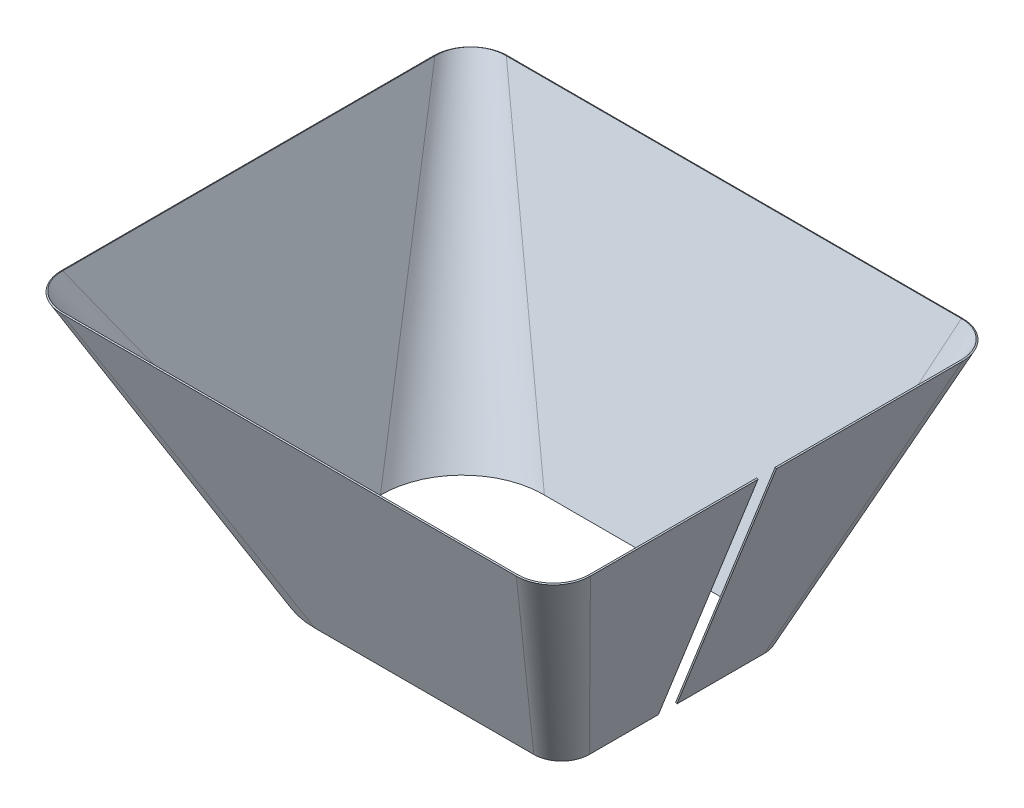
ISO-10303-21;
HEADER;
FILE_DESCRIPTION(('STEP AP214'),'2;1');
FILE_NAME('part.step','',(''),(''),'','','');
FILE_SCHEMA(('AUTOMOTIVE_DESIGN { 1 0 10303 214 1 1 1 1 }'));
ENDSEC;
DATA;
#1=APPLICATION_CONTEXT('core data for automotive mechanical design processes');
#2=APPLICATION_PROTOCOL_DEFINITION('international standard','automotive_design',2000,#1);
#3=PRODUCT_CONTEXT('',#1,'mechanical');
#4=PRODUCT('Part','Part','',(#3));
#5=PRODUCT_RELATED_PRODUCT_CATEGORY('part','',(#4));
#6=PRODUCT_DEFINITION_FORMATION('','',#4);
#7=PRODUCT_DEFINITION_CONTEXT('part definition',#1,'design');
#8=PRODUCT_DEFINITION('design','',#6,#7);
#9=PRODUCT_DEFINITION_SHAPE('','',#8);
#10=(LENGTH_UNIT() NAMED_UNIT(*) SI_UNIT(.MILLI.,.METRE.));
#11=(NAMED_UNIT(*) PLANE_ANGLE_UNIT() SI_UNIT($,.RADIAN.));
#12=(NAMED_UNIT(*) SI_UNIT($,.STERADIAN.) SOLID_ANGLE_UNIT());
#13=UNCERTAINTY_MEASURE_WITH_UNIT(LENGTH_MEASURE(1.E-05),#10,'distance_accuracy_value','');
#14=(GEOMETRIC_REPRESENTATION_CONTEXT(3) GLOBAL_UNCERTAINTY_ASSIGNED_CONTEXT((#13)) GLOBAL_UNIT_ASSIGNED_CONTEXT((#10,
#11,#12)) REPRESENTATION_CONTEXT('',''));
#15=CARTESIAN_POINT('',(0.,0.,0.));
#16=DIRECTION('',(0.,0.,1.));
#17=DIRECTION('',(1.,0.,0.));
#18=AXIS2_PLACEMENT_3D('',#15,#16,#17);
#19=CARTESIAN_POINT('',(145.195079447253,139.182430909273,0.));
#20=DIRECTION('',(0.365587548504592,0.930776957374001,0.));
#21=DIRECTION('',(0.,0.,-1.));
#22=AXIS2_PLACEMENT_3D('',#19,#20,#21);
#23=PLANE('',#22);
#24=DIRECTION('',(-0.930776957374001,0.365587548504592,0.));
#25=VECTOR('',#24,1.);
#26=CARTESIAN_POINT('',(145.195079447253,139.182430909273,0.));
#27=LINE('',#26,#25);
#28=CARTESIAN_POINT('',(145.195079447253,139.182430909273,0.));
#29=VERTEX_POINT('',#28);
#30=CARTESIAN_POINT('',(144.462185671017,139.470294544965,0.));
#31=VERTEX_POINT('',#30);
#32=EDGE_CURVE('E14',#29,#31,#27,.T.);
#33=ORIENTED_EDGE('',*,*,#32,.F.);
#34=DIRECTION('',(0.,0.,-1.));
#35=VECTOR('',#34,1.);
#36=CARTESIAN_POINT('',(145.195079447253,139.182430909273,0.));
#37=LINE('',#36,#35);
#38=CARTESIAN_POINT('',(145.195079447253,139.182430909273,-102.166844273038));
#39=VERTEX_POINT('',#38);
#40=EDGE_CURVE('E644',#29,#39,#37,.T.);
#41=ORIENTED_EDGE('',*,*,#40,.T.);
#42=CARTESIAN_POINT('',(144.462185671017,139.470294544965,-102.166844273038));
#43=CARTESIAN_POINT('',(145.195079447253,139.182430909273,-102.166844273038));
#44=B_SPLINE_CURVE_WITH_KNOTS('',1,(#42,#43),.UNSPECIFIED.,.F.,.F.,(2,2),(0.,1.),.UNSPECIFIED.);
#45=CARTESIAN_POINT('',(144.462185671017,139.470294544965,-102.166844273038));
#46=VERTEX_POINT('',#45);
#47=EDGE_CURVE('E128',#39,#46,#44,.F.);
#48=ORIENTED_EDGE('',*,*,#47,.T.);
#49=DIRECTION('',(0.,0.,1.));
#50=VECTOR('',#49,1.);
#51=CARTESIAN_POINT('',(144.462185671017,139.470294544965,-48.0736812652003));
#52=LINE('',#51,#50);
#53=EDGE_CURVE('E649',#31,#46,#52,.F.);
#54=ORIENTED_EDGE('',*,*,#53,.F.);
#55=EDGE_LOOP('',(#33,#41,#48,#54));
#56=FACE_BOUND('',#55,.T.);
#57=ADVANCED_FACE('F118',(#56),#23,.T.);
#58=CARTESIAN_POINT('',(144.462185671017,139.470294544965,-102.166844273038));
#59=CARTESIAN_POINT('',(144.475298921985,139.503680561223,-104.871013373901));
#60=CARTESIAN_POINT('',(143.938486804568,139.52773257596,-107.450724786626));
#61=CARTESIAN_POINT('',(141.967134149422,139.559360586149,-112.150068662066));
#62=CARTESIAN_POINT('',(140.532384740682,139.567330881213,-114.269277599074));
#63=CARTESIAN_POINT('',(136.978719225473,139.570360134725,-117.825356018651));
#64=CARTESIAN_POINT('',(134.860233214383,139.565429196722,-119.261803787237));
#65=CARTESIAN_POINT('',(130.160875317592,139.540464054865,-121.236430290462));
#66=CARTESIAN_POINT('',(127.580403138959,139.520087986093,-121.774791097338));
#67=CARTESIAN_POINT('',(124.875079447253,139.490506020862,-121.762214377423));
#68=CARTESIAN_POINT('',(145.195079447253,139.182430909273,-102.166844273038));
#69=CARTESIAN_POINT('',(145.195079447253,139.182430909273,-104.970572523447));
#70=CARTESIAN_POINT('',(144.626011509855,139.182430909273,-107.642436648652));
#71=CARTESIAN_POINT('',(142.568341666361,139.182430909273,-112.503834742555));
#72=CARTESIAN_POINT('',(141.079739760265,139.182430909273,-114.693368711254));
#73=CARTESIAN_POINT('',(137.401603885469,139.182430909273,-118.37150458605));
#74=CARTESIAN_POINT('',(135.21206991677,139.182430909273,-119.860106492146));
#75=CARTESIAN_POINT('',(130.350671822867,139.182430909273,-121.91777633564));
#76=CARTESIAN_POINT('',(127.678807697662,139.182430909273,-122.486844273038));
#77=CARTESIAN_POINT('',(124.875079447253,139.182430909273,-122.486844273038));
#78=B_SPLINE_SURFACE_WITH_KNOTS('',1,3,((#58,#59,#60,#61,#62,#63,#64,#65,#66,#67),(#68,#69,#70,
#71,#72,#73,#74,#75,#76,#77)),.UNSPECIFIED.,.F.,.F.,.F.,(2,2),(4,2,2,2,4),(0.,1.),(0.,0.25,0.5,
0.75,1.),.UNSPECIFIED.);
#79=CARTESIAN_POINT('',(145.195079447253,139.182430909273,-102.166844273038));
#80=CARTESIAN_POINT('',(145.195079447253,139.182430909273,-104.970572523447));
#81=CARTESIAN_POINT('',(144.626011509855,139.182430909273,-107.642436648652));
#82=CARTESIAN_POINT('',(142.568341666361,139.182430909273,-112.503834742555));
#83=CARTESIAN_POINT('',(141.079739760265,139.182430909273,-114.693368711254));
#84=CARTESIAN_POINT('',(137.401603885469,139.182430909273,-118.37150458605));
#85=CARTESIAN_POINT('',(135.21206991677,139.182430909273,-119.860106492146));
#86=CARTESIAN_POINT('',(130.350671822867,139.182430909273,-121.91777633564));
#87=CARTESIAN_POINT('',(127.678807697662,139.182430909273,-122.486844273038));
#88=CARTESIAN_POINT('',(124.875079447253,139.182430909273,-122.486844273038));
#89=B_SPLINE_CURVE_WITH_KNOTS('',3,(#79,#80,#81,#82,#83,#84,#85,#86,#87,#88),.UNSPECIFIED.,.F.,
.F.,(4,2,2,2,4),(0.,0.25,0.5,0.75,1.),.UNSPECIFIED.);
#90=CARTESIAN_POINT('',(124.875079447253,139.182430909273,-122.486844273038));
#91=VERTEX_POINT('',#90);
#92=EDGE_CURVE('E289',#39,#91,#89,.T.);
#93=CARTESIAN_POINT('',(124.875079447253,139.182430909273,-122.486844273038));
#94=CARTESIAN_POINT('',(124.875079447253,139.490506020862,-121.762214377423));
#95=B_SPLINE_CURVE_WITH_KNOTS('',1,(#93,#94),.UNSPECIFIED.,.F.,.F.,(2,2),(0.,1.),.UNSPECIFIED.);
#96=CARTESIAN_POINT('',(124.875079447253,139.490506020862,-121.762214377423));
#97=VERTEX_POINT('',#96);
#98=EDGE_CURVE('E1136',#91,#97,#95,.T.);
#99=CARTESIAN_POINT('',(144.462185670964,139.470294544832,-102.166844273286));
#100=CARTESIAN_POINT('',(144.463831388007,139.47444527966,-102.502973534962));
#101=CARTESIAN_POINT('',(144.456963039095,139.478480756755,-102.839153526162));
#102=CARTESIAN_POINT('',(144.42625748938,139.486264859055,-103.507167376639));
#103=CARTESIAN_POINT('',(144.402600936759,139.490016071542,-103.839009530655));
#104=CARTESIAN_POINT('',(144.338717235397,139.497229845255,-104.497952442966));
#105=CARTESIAN_POINT('',(144.298647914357,139.50069478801,-104.825068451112));
#106=CARTESIAN_POINT('',(144.202358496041,139.507338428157,-105.474153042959));
#107=CARTESIAN_POINT('',(144.146274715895,139.510519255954,-105.796141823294));
#108=CARTESIAN_POINT('',(144.018368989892,139.516599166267,-106.434562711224));
#109=CARTESIAN_POINT('',(143.946663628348,139.519500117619,-106.751018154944));
#110=CARTESIAN_POINT('',(143.787928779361,139.525026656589,-107.377958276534));
#111=CARTESIAN_POINT('',(143.700997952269,139.527653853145,-107.688467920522));
#112=CARTESIAN_POINT('',(143.512226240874,139.532640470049,-108.303098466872));
#113=CARTESIAN_POINT('',(143.410467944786,139.535001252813,-108.607244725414));
#114=CARTESIAN_POINT('',(143.192456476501,139.539463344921,-109.208727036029));
#115=CARTESIAN_POINT('',(143.076271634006,139.54156579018,-109.506087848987));
#116=CARTESIAN_POINT('',(142.829823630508,139.545519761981,-110.093574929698));
#117=CARTESIAN_POINT('',(142.699616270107,139.547372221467,-110.383724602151));
#118=CARTESIAN_POINT('',(142.425541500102,139.550834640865,-110.956362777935));
#119=CARTESIAN_POINT('',(142.281718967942,139.552445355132,-111.238872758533));
#120=CARTESIAN_POINT('',(141.980834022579,139.555432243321,-111.79580324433));
#121=CARTESIAN_POINT('',(141.823807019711,139.556809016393,-112.070242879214));
#122=CARTESIAN_POINT('',(141.496935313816,139.55933525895,-112.610603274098));
#123=CARTESIAN_POINT('',(141.327117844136,139.560485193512,-112.876540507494));
#124=CARTESIAN_POINT('',(140.975089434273,139.562564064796,-113.399466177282));
#125=CARTESIAN_POINT('',(140.792898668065,139.563493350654,-113.656468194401));
#126=CARTESIAN_POINT('',(140.416549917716,139.565136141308,-114.161093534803));
#127=CARTESIAN_POINT('',(140.222405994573,139.56584989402,-114.408727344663));
#128=CARTESIAN_POINT('',(139.822579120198,139.567065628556,-114.894186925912));
#129=CARTESIAN_POINT('',(139.61690489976,139.567567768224,-115.132019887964));
#130=CARTESIAN_POINT('',(139.194447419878,139.568363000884,-115.597449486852));
#131=CARTESIAN_POINT('',(138.9776681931,139.568656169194,-115.825049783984));
#132=CARTESIAN_POINT('',(138.53343229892,139.569034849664,-116.269587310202));
#133=CARTESIAN_POINT('',(138.305975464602,139.569120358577,-116.486524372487));
#134=CARTESIAN_POINT('',(137.840817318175,139.56908375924,-116.90931070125));
#135=CARTESIAN_POINT('',(137.603112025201,139.56896156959,-117.115155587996));
#136=CARTESIAN_POINT('',(137.117890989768,139.56850827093,-117.515335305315));
#137=CARTESIAN_POINT('',(136.870367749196,139.568176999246,-117.709661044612));
#138=CARTESIAN_POINT('',(136.365945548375,139.56730293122,-118.086383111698));
#139=CARTESIAN_POINT('',(136.109035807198,139.566759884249,-118.268765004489));
#140=CARTESIAN_POINT('',(135.586275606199,139.565458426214,-118.621183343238));
#141=CARTESIAN_POINT('',(135.320411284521,139.564699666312,-118.791199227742));
#142=CARTESIAN_POINT('',(134.780176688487,139.56296180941,-119.118473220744));
#143=CARTESIAN_POINT('',(134.505789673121,139.561982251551,-119.275703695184));
#144=CARTESIAN_POINT('',(133.948943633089,139.559796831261,-119.576998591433));
#145=CARTESIAN_POINT('',(133.66646522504,139.558590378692,-119.721027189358));
#146=CARTESIAN_POINT('',(133.093868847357,139.555944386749,-119.995514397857));
#147=CARTESIAN_POINT('',(132.803729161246,139.554504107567,-120.12592770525));
#148=CARTESIAN_POINT('',(132.216240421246,139.551383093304,-120.37278494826));
#149=CARTESIAN_POINT('',(131.918867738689,139.549701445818,-120.489172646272));
#150=CARTESIAN_POINT('',(131.317340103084,139.546090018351,-120.70758395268));
#151=CARTESIAN_POINT('',(131.013160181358,139.54415912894,-120.809538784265));
#152=CARTESIAN_POINT('',(130.398441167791,139.540041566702,-120.998694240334));
#153=CARTESIAN_POINT('',(130.087876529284,139.537853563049,-121.085811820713));
#154=CARTESIAN_POINT('',(129.460806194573,139.533214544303,-121.244907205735));
#155=CARTESIAN_POINT('',(129.144275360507,139.530761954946,-121.31678588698));
#156=CARTESIAN_POINT('',(128.50568492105,139.525587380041,-121.445021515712));
#157=CARTESIAN_POINT('',(128.183601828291,139.522863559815,-121.501261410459));
#158=CARTESIAN_POINT('',(127.534311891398,139.517141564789,-121.597842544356));
#159=CARTESIAN_POINT('',(127.207084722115,139.514141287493,-121.638046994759));
#160=CARTESIAN_POINT('',(126.547905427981,139.507863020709,-121.702176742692));
#161=CARTESIAN_POINT('',(126.215937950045,139.504582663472,-121.725943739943));
#162=CARTESIAN_POINT('',(125.547662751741,139.497744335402,-121.756842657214));
#163=CARTESIAN_POINT('',(125.211346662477,139.49418376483,-121.763793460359));
#164=CARTESIAN_POINT('',(124.875079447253,139.490506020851,-121.762214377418));
#165=B_SPLINE_CURVE_WITH_KNOTS('',3,(#99,#100,#101,#102,#103,#104,#105,#106,#107,#108,#109,#110,
#111,#112,#113,#114,#115,#116,#117,#118,#119,#120,#121,#122,#123,#124,#125,#126,#127,#128,#129,
#130,#131,#132,#133,#134,#135,#136,#137,#138,#139,#140,#141,#142,#143,#144,#145,#146,#147,#148,
#149,#150,#151,#152,#153,#154,#155,#156,#157,#158,#159,#160,#161,#162,#163,#164),.UNSPECIFIED.,
.F.,.F.,(4,2,2,2,2,2,2,2,2,2,2,2,2,2,2,2,2,2,2,2,2,2,2,2,2,2,2,2,2,2,2,2,4),(0.,
1.00838012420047,2.00607102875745,2.99438517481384,3.97452538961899,4.94758714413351,
5.91456224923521,6.87634381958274,7.83373236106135,8.78744282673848,9.73811247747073,
10.6863094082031,11.6325416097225,12.5772664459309,13.5209004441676,14.463829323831,
15.4064181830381,16.3490217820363,17.2919948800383,18.235702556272,19.1805304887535,
20.1268951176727,21.0752536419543,22.0261137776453,22.9800431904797,23.9376785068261,
24.899733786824,25.867008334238,26.8403936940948,27.8208796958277,28.809559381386,
29.807632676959,30.816408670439),.UNSPECIFIED.);
#166=EDGE_CURVE('E659',#46,#97,#165,.T.);
#167=ORIENTED_EDGE('',*,*,#47,.F.);
#168=ORIENTED_EDGE('',*,*,#92,.T.);
#169=ORIENTED_EDGE('',*,*,#98,.T.);
#170=ORIENTED_EDGE('',*,*,#166,.F.);
#171=EDGE_LOOP('',(#167,#168,#169,#170));
#172=FACE_BOUND('',#171,.T.);
#173=ADVANCED_FACE('F1141',(#172),#78,.T.);
#174=CARTESIAN_POINT('',(124.875079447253,139.182430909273,-122.486844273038));
#175=DIRECTION('',(0.,0.920281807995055,-0.391256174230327));
#176=DIRECTION('',(-1.,0.,0.));
#177=AXIS2_PLACEMENT_3D('',#174,#175,#176);
#178=PLANE('',#177);
#179=ORIENTED_EDGE('',*,*,#98,.F.);
#180=DIRECTION('',(-1.,0.,0.));
#181=VECTOR('',#180,1.);
#182=CARTESIAN_POINT('',(124.875079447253,139.182430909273,-122.486844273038));
#183=LINE('',#182,#181);
#184=CARTESIAN_POINT('',(-124.875079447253,139.182430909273,-122.486844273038));
#185=VERTEX_POINT('',#184);
#186=EDGE_CURVE('E702',#91,#185,#183,.T.);
#187=ORIENTED_EDGE('',*,*,#186,.T.);
#188=CARTESIAN_POINT('',(-124.875079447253,139.490506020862,-121.762214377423));
#189=CARTESIAN_POINT('',(-124.875079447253,139.182430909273,-122.486844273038));
#190=B_SPLINE_CURVE_WITH_KNOTS('',1,(#188,#189),.UNSPECIFIED.,.F.,.F.,(2,2),(0.,1.),.UNSPECIFIED.);
#191=CARTESIAN_POINT('',(-124.875079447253,139.490506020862,-121.762214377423));
#192=VERTEX_POINT('',#191);
#193=EDGE_CURVE('E1115',#185,#192,#190,.F.);
#194=ORIENTED_EDGE('',*,*,#193,.T.);
#195=DIRECTION('',(1.,0.,0.));
#196=VECTOR('',#195,1.);
#197=CARTESIAN_POINT('',(-44.8074565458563,139.490506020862,-121.762214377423));
#198=LINE('',#197,#196);
#199=EDGE_CURVE('E678',#97,#192,#198,.F.);
#200=ORIENTED_EDGE('',*,*,#199,.F.);
#201=EDGE_LOOP('',(#179,#187,#194,#200));
#202=FACE_BOUND('',#201,.T.);
#203=ADVANCED_FACE('F1075',(#202),#178,.T.);
#204=CARTESIAN_POINT('',(-124.875079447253,139.490506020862,-121.762214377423));
#205=CARTESIAN_POINT('',(-127.580298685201,139.538269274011,-121.782520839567));
#206=CARTESIAN_POINT('',(-130.164402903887,139.569204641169,-121.251461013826));
#207=CARTESIAN_POINT('',(-134.872276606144,139.607167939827,-119.283560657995));
#208=CARTESIAN_POINT('',(-136.995449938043,139.614742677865,-117.846951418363));
#209=CARTESIAN_POINT('',(-140.553945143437,139.612058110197,-114.285973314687));
#210=CARTESIAN_POINT('',(-141.988797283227,139.601794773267,-112.162047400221));
#211=CARTESIAN_POINT('',(-143.953287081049,139.557340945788,-107.454179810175));
#212=CARTESIAN_POINT('',(-144.482686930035,139.52249024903,-104.87088861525));
#213=CARTESIAN_POINT('',(-144.462185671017,139.470294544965,-102.166844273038));
#214=CARTESIAN_POINT('',(-124.875079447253,139.182430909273,-122.486844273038));
#215=CARTESIAN_POINT('',(-127.678807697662,139.182430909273,-122.486844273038));
#216=CARTESIAN_POINT('',(-130.350671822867,139.182430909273,-121.91777633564));
#217=CARTESIAN_POINT('',(-135.21206991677,139.182430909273,-119.860106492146));
#218=CARTESIAN_POINT('',(-137.401603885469,139.182430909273,-118.37150458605));
#219=CARTESIAN_POINT('',(-141.079739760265,139.182430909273,-114.693368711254));
#220=CARTESIAN_POINT('',(-142.568341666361,139.182430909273,-112.503834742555));
#221=CARTESIAN_POINT('',(-144.626011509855,139.182430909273,-107.642436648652));
#222=CARTESIAN_POINT('',(-145.195079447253,139.182430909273,-104.970572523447));
#223=CARTESIAN_POINT('',(-145.195079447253,139.182430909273,-102.166844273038));
#224=B_SPLINE_SURFACE_WITH_KNOTS('',1,3,((#204,#205,#206,#207,#208,#209,#210,#211,#212,#213),
(#214,#215,#216,#217,#218,#219,#220,#221,#222,#223)),.UNSPECIFIED.,.F.,.F.,.F.,(2,2),(4,2,2,2,
4),(0.,1.),(0.,0.25,0.5,0.75,1.),.UNSPECIFIED.);
#225=CARTESIAN_POINT('',(-124.875079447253,139.182430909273,-122.486844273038));
#226=CARTESIAN_POINT('',(-127.678807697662,139.182430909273,-122.486844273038));
#227=CARTESIAN_POINT('',(-130.350671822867,139.182430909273,-121.91777633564));
#228=CARTESIAN_POINT('',(-135.21206991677,139.182430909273,-119.860106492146));
#229=CARTESIAN_POINT('',(-137.401603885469,139.182430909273,-118.37150458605));
#230=CARTESIAN_POINT('',(-141.079739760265,139.182430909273,-114.693368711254));
#231=CARTESIAN_POINT('',(-142.568341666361,139.182430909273,-112.503834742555));
#232=CARTESIAN_POINT('',(-144.626011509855,139.182430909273,-107.642436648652));
#233=CARTESIAN_POINT('',(-145.195079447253,139.182430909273,-104.970572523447));
#234=CARTESIAN_POINT('',(-145.195079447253,139.182430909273,-102.166844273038));
#235=B_SPLINE_CURVE_WITH_KNOTS('',3,(#225,#226,#227,#228,#229,#230,#231,#232,#233,#234),
.UNSPECIFIED.,.F.,.F.,(4,2,2,2,4),(0.,0.25,0.5,0.75,1.),.UNSPECIFIED.);
#236=CARTESIAN_POINT('',(-145.195079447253,139.182430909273,-102.166844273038));
#237=VERTEX_POINT('',#236);
#238=EDGE_CURVE('E721',#185,#237,#235,.T.);
#239=CARTESIAN_POINT('',(-145.195079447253,139.182430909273,-102.166844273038));
#240=CARTESIAN_POINT('',(-144.462185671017,139.470294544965,-102.166844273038));
#241=B_SPLINE_CURVE_WITH_KNOTS('',1,(#239,#240),.UNSPECIFIED.,.F.,.F.,(2,2),(0.,1.),.UNSPECIFIED.);
#242=CARTESIAN_POINT('',(-144.462185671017,139.470294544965,-102.166844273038));
#243=VERTEX_POINT('',#242);
#244=EDGE_CURVE('E1103',#237,#243,#241,.T.);
#245=CARTESIAN_POINT('',(-124.87507944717,139.490506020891,-121.762214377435));
#246=CARTESIAN_POINT('',(-125.211368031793,139.496445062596,-121.764754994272));
#247=CARTESIAN_POINT('',(-125.547733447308,139.50216236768,-121.758773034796));
#248=CARTESIAN_POINT('',(-126.216204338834,139.513087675,-121.729794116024));
#249=CARTESIAN_POINT('',(-126.548317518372,139.518300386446,-121.706976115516));
#250=CARTESIAN_POINT('',(-127.207880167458,139.528229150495,-121.644702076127));
#251=CARTESIAN_POINT('',(-127.535344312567,139.532949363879,-121.605402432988));
#252=CARTESIAN_POINT('',(-128.185190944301,139.541911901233,-121.510569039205));
#253=CARTESIAN_POINT('',(-128.507593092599,139.546157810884,-121.455170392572));
#254=CARTESIAN_POINT('',(-129.146893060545,139.554192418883,-121.328539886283));
#255=CARTESIAN_POINT('',(-129.463813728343,139.557984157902,-121.257423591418));
#256=CARTESIAN_POINT('',(-130.091722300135,139.565132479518,-121.099764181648));
#257=CARTESIAN_POINT('',(-130.402734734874,139.568491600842,-121.013318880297));
#258=CARTESIAN_POINT('',(-131.018394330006,139.574796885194,-120.825411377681));
#259=CARTESIAN_POINT('',(-131.323066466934,139.577745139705,-120.724031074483));
#260=CARTESIAN_POINT('',(-131.92560974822,139.583250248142,-120.50666757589));
#261=CARTESIAN_POINT('',(-132.223505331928,139.585808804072,-120.390752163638));
#262=CARTESIAN_POINT('',(-132.812057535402,139.590554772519,-120.14473626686));
#263=CARTESIAN_POINT('',(-133.102737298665,139.592743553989,-120.014691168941));
#264=CARTESIAN_POINT('',(-133.676418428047,139.596768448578,-119.740837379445));
#265=CARTESIAN_POINT('',(-133.95944107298,139.598605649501,-119.597073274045));
#266=CARTESIAN_POINT('',(-134.517367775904,139.601943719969,-119.296206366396));
#267=CARTESIAN_POINT('',(-134.792290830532,139.60344544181,-119.13913879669));
#268=CARTESIAN_POINT('',(-135.333578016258,139.606126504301,-118.812093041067));
#269=CARTESIAN_POINT('',(-135.599958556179,139.607306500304,-118.642142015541));
#270=CARTESIAN_POINT('',(-136.123720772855,139.609355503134,-118.289760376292));
#271=CARTESIAN_POINT('',(-136.381116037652,139.610224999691,-118.107349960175));
#272=CARTESIAN_POINT('',(-136.886468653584,139.611661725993,-117.730483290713));
#273=CARTESIAN_POINT('',(-137.134436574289,139.612229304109,-117.536041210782));
#274=CARTESIAN_POINT('',(-137.620496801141,139.613068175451,-117.135547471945));
#275=CARTESIAN_POINT('',(-137.858596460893,139.613339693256,-116.929504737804));
#276=CARTESIAN_POINT('',(-138.324484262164,139.613589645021,-116.506248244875));
#277=CARTESIAN_POINT('',(-138.552276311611,139.613568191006,-116.289038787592));
#278=CARTESIAN_POINT('',(-138.997115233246,139.613232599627,-115.843889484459));
#279=CARTESIAN_POINT('',(-139.214162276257,139.612918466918,-115.61594980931));
#280=CARTESIAN_POINT('',(-139.637080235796,139.61199511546,-115.149782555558));
#281=CARTESIAN_POINT('',(-139.842947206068,139.611385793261,-114.911551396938));
#282=CARTESIAN_POINT('',(-140.243077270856,139.609866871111,-114.425245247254));
#283=CARTESIAN_POINT('',(-140.437331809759,139.608957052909,-114.17716321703));
#284=CARTESIAN_POINT('',(-140.813812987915,139.606829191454,-113.671600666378));
#285=CARTESIAN_POINT('',(-140.996025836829,139.605610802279,-113.41410987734));
#286=CARTESIAN_POINT('',(-141.348003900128,139.602855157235,-112.890176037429));
#287=CARTESIAN_POINT('',(-141.517749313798,139.601317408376,-112.623719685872));
#288=CARTESIAN_POINT('',(-141.844377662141,139.597909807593,-112.08230135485));
#289=CARTESIAN_POINT('',(-142.001233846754,139.596039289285,-111.807323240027));
#290=CARTESIAN_POINT('',(-142.301674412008,139.591950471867,-111.249307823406));
#291=CARTESIAN_POINT('',(-142.445223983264,139.58973129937,-110.966251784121));
#292=CARTESIAN_POINT('',(-142.718648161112,139.584927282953,-110.392526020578));
#293=CARTESIAN_POINT('',(-142.848478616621,139.58234131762,-110.101835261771));
#294=CARTESIAN_POINT('',(-143.094068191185,139.576783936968,-109.513283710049));
#295=CARTESIAN_POINT('',(-143.209772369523,139.573811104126,-109.215400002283));
#296=CARTESIAN_POINT('',(-143.426720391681,139.567458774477,-108.612903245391));
#297=CARTESIAN_POINT('',(-143.527896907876,139.564077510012,-108.308265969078));
#298=CARTESIAN_POINT('',(-143.715408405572,139.556886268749,-107.692698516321));
#299=CARTESIAN_POINT('',(-143.801661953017,139.553074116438,-107.381743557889));
#300=CARTESIAN_POINT('',(-143.958954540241,139.54499901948,-106.753971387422));
#301=CARTESIAN_POINT('',(-144.029896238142,139.540733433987,-106.437129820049));
#302=CARTESIAN_POINT('',(-144.156199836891,139.531730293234,-105.798007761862));
#303=CARTESIAN_POINT('',(-144.211446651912,139.526989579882,-105.475704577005));
#304=CARTESIAN_POINT('',(-144.30600462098,139.517017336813,-104.826072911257));
#305=CARTESIAN_POINT('',(-144.345181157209,139.511782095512,-104.498724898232));
#306=CARTESIAN_POINT('',(-144.407243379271,139.500804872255,-103.839407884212));
#307=CARTESIAN_POINT('',(-144.429973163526,139.495058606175,-103.507424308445));
#308=CARTESIAN_POINT('',(-144.458815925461,139.483051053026,-102.839221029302));
#309=CARTESIAN_POINT('',(-144.464750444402,139.476784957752,-102.502993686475));
#310=CARTESIAN_POINT('',(-144.462185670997,139.470294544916,-102.166844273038));
#311=B_SPLINE_CURVE_WITH_KNOTS('',3,(#245,#246,#247,#248,#249,#250,#251,#252,#253,#254,#255,
#256,#257,#258,#259,#260,#261,#262,#263,#264,#265,#266,#267,#268,#269,#270,#271,#272,#273,#274,
#275,#276,#277,#278,#279,#280,#281,#282,#283,#284,#285,#286,#287,#288,#289,#290,#291,#292,#293,
#294,#295,#296,#297,#298,#299,#300,#301,#302,#303,#304,#305,#306,#307,#308,#309,#310),
.UNSPECIFIED.,.F.,.F.,(4,2,2,2,2,2,2,2,2,2,2,2,2,2,2,2,2,2,2,2,2,2,2,2,2,2,2,2,2,2,2,2,4),(0.,
1.00895636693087,2.00733977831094,2.9964564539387,3.97750094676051,4.95155899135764,
5.91961171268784,6.88254103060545,7.8411361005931,8.79610063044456,9.74806091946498,
10.69757449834,11.6451392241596,12.5912027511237,13.53617227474,14.4804244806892,
15.4243156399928,16.3681917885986,17.3123989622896,18.2572934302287,19.2032518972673,
20.1506816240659,21.1000304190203,22.0517964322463,23.0065376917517,23.9648812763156,
24.9275320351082,25.8952807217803,26.8690114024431,27.8497079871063,28.8384597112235,
29.8364653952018,30.8450363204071),.UNSPECIFIED.);
#312=EDGE_CURVE('E1037',#192,#243,#311,.T.);
#313=ORIENTED_EDGE('',*,*,#193,.F.);
#314=ORIENTED_EDGE('',*,*,#238,.T.);
#315=ORIENTED_EDGE('',*,*,#244,.T.);
#316=ORIENTED_EDGE('',*,*,#312,.F.);
#317=EDGE_LOOP('',(#313,#314,#315,#316));
#318=FACE_BOUND('',#317,.T.);
#319=ADVANCED_FACE('F1064',(#318),#224,.T.);
#320=CARTESIAN_POINT('',(-145.195079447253,139.182430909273,102.166844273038));
#321=DIRECTION('',(0.365587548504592,-0.930776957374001,0.));
#322=DIRECTION('',(0.,0.,1.));
#323=AXIS2_PLACEMENT_3D('',#320,#321,#322);
#324=PLANE('',#323);
#325=ORIENTED_EDGE('',*,*,#244,.F.);
#326=DIRECTION('',(0.,0.,1.));
#327=VECTOR('',#326,1.);
#328=CARTESIAN_POINT('',(-145.195079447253,139.182430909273,102.166844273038));
#329=LINE('',#328,#327);
#330=CARTESIAN_POINT('',(-145.195079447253,139.182430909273,102.166844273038));
#331=VERTEX_POINT('',#330);
#332=EDGE_CURVE('E1244',#237,#331,#329,.T.);
#333=ORIENTED_EDGE('',*,*,#332,.T.);
#334=CARTESIAN_POINT('',(-144.462185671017,139.470294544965,102.166844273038));
#335=CARTESIAN_POINT('',(-145.195079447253,139.182430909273,102.166844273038));
#336=B_SPLINE_CURVE_WITH_KNOTS('',1,(#334,#335),.UNSPECIFIED.,.F.,.F.,(2,2),(0.,1.),.UNSPECIFIED.);
#337=CARTESIAN_POINT('',(-144.462185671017,139.470294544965,102.166844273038));
#338=VERTEX_POINT('',#337);
#339=EDGE_CURVE('E1181',#331,#338,#336,.F.);
#340=ORIENTED_EDGE('',*,*,#339,.T.);
#341=DIRECTION('',(0.,0.,1.));
#342=VECTOR('',#341,1.);
#343=CARTESIAN_POINT('',(-144.462185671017,139.470294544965,102.166844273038));
#344=LINE('',#343,#342);
#345=EDGE_CURVE('E1259',#243,#338,#344,.T.);
#346=ORIENTED_EDGE('',*,*,#345,.F.);
#347=EDGE_LOOP('',(#325,#333,#340,#346));
#348=FACE_BOUND('',#347,.T.);
#349=ADVANCED_FACE('F997',(#348),#324,.F.);
#350=CARTESIAN_POINT('',(-144.462185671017,139.470294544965,102.166844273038));
#351=CARTESIAN_POINT('',(-144.482686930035,139.52249024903,104.87088861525));
#352=CARTESIAN_POINT('',(-143.953287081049,139.557340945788,107.454179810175));
#353=CARTESIAN_POINT('',(-141.988797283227,139.601794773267,112.162047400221));
#354=CARTESIAN_POINT('',(-140.553945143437,139.612058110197,114.285973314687));
#355=CARTESIAN_POINT('',(-136.995449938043,139.614742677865,117.846951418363));
#356=CARTESIAN_POINT('',(-134.872276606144,139.607167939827,119.283560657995));
#357=CARTESIAN_POINT('',(-130.164402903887,139.569204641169,121.251461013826));
#358=CARTESIAN_POINT('',(-127.580298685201,139.538269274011,121.782520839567));
#359=CARTESIAN_POINT('',(-124.875079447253,139.490506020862,121.762214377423));
#360=CARTESIAN_POINT('',(-145.195079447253,139.182430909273,102.166844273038));
#361=CARTESIAN_POINT('',(-145.195079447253,139.182430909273,104.970572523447));
#362=CARTESIAN_POINT('',(-144.626011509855,139.182430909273,107.642436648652));
#363=CARTESIAN_POINT('',(-142.568341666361,139.182430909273,112.503834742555));
#364=CARTESIAN_POINT('',(-141.079739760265,139.182430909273,114.693368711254));
#365=CARTESIAN_POINT('',(-137.401603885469,139.182430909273,118.37150458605));
#366=CARTESIAN_POINT('',(-135.21206991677,139.182430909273,119.860106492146));
#367=CARTESIAN_POINT('',(-130.350671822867,139.182430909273,121.91777633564));
#368=CARTESIAN_POINT('',(-127.678807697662,139.182430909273,122.486844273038));
#369=CARTESIAN_POINT('',(-124.875079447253,139.182430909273,122.486844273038));
#370=B_SPLINE_SURFACE_WITH_KNOTS('',1,3,((#350,#351,#352,#353,#354,#355,#356,#357,#358,#359),
(#360,#361,#362,#363,#364,#365,#366,#367,#368,#369)),.UNSPECIFIED.,.F.,.F.,.F.,(2,2),(4,2,2,2,
4),(0.,1.),(0.,0.25,0.5,0.75,1.),.UNSPECIFIED.);
#371=CARTESIAN_POINT('',(-145.195079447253,139.182430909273,102.166844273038));
#372=CARTESIAN_POINT('',(-145.195079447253,139.182430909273,104.970572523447));
#373=CARTESIAN_POINT('',(-144.626011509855,139.182430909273,107.642436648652));
#374=CARTESIAN_POINT('',(-142.568341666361,139.182430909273,112.503834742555));
#375=CARTESIAN_POINT('',(-141.079739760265,139.182430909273,114.693368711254));
#376=CARTESIAN_POINT('',(-137.401603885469,139.182430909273,118.37150458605));
#377=CARTESIAN_POINT('',(-135.21206991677,139.182430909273,119.860106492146));
#378=CARTESIAN_POINT('',(-130.350671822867,139.182430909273,121.91777633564));
#379=CARTESIAN_POINT('',(-127.678807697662,139.182430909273,122.486844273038));
#380=CARTESIAN_POINT('',(-124.875079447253,139.182430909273,122.486844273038));
#381=B_SPLINE_CURVE_WITH_KNOTS('',3,(#371,#372,#373,#374,#375,#376,#377,#378,#379,#380),
.UNSPECIFIED.,.F.,.F.,(4,2,2,2,4),(0.,0.25,0.5,0.75,1.),.UNSPECIFIED.);
#382=CARTESIAN_POINT('',(-124.875079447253,139.182430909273,122.486844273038));
#383=VERTEX_POINT('',#382);
#384=EDGE_CURVE('E437',#331,#383,#381,.T.);
#385=CARTESIAN_POINT('',(-124.875079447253,139.182430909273,122.486844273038));
#386=CARTESIAN_POINT('',(-124.875079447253,139.490506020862,121.762214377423));
#387=B_SPLINE_CURVE_WITH_KNOTS('',1,(#385,#386),.UNSPECIFIED.,.F.,.F.,(2,2),(0.,1.),.UNSPECIFIED.);
#388=CARTESIAN_POINT('',(-124.875079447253,139.490506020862,121.762214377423));
#389=VERTEX_POINT('',#388);
#390=EDGE_CURVE('E981',#383,#389,#387,.T.);
#391=CARTESIAN_POINT('',(-144.462185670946,139.470294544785,102.166844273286));
#392=CARTESIAN_POINT('',(-144.464750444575,139.476784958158,102.50299368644));
#393=CARTESIAN_POINT('',(-144.458815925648,139.483051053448,102.839221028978));
#394=CARTESIAN_POINT('',(-144.429973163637,139.49505860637,103.507424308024));
#395=CARTESIAN_POINT('',(-144.40724337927,139.500804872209,103.839407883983));
#396=CARTESIAN_POINT('',(-144.345181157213,139.511782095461,104.498724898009));
#397=CARTESIAN_POINT('',(-144.30600462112,139.517017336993,104.826072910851));
#398=CARTESIAN_POINT('',(-144.211446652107,139.52698958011,105.475704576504));
#399=CARTESIAN_POINT('',(-144.156199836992,139.531730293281,105.798007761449));
#400=CARTESIAN_POINT('',(-144.029896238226,139.540733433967,106.437129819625));
#401=CARTESIAN_POINT('',(-143.958954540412,139.544999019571,106.753971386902));
#402=CARTESIAN_POINT('',(-143.801661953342,139.553074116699,107.381743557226));
#403=CARTESIAN_POINT('',(-143.715408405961,139.55688626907,107.69269851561));
#404=CARTESIAN_POINT('',(-143.527896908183,139.564077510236,108.308265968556));
#405=CARTESIAN_POINT('',(-143.426720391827,139.567458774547,108.612903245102));
#406=CARTESIAN_POINT('',(-143.209772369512,139.573811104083,109.215400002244));
#407=CARTESIAN_POINT('',(-143.09406819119,139.576783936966,109.513283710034));
#408=CARTESIAN_POINT('',(-142.848478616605,139.582341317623,110.10183526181));
#409=CARTESIAN_POINT('',(-142.718648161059,139.58492728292,110.392526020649));
#410=CARTESIAN_POINT('',(-142.445223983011,139.589731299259,110.966251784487));
#411=CARTESIAN_POINT('',(-142.30167441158,139.591950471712,111.24930782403));
#412=CARTESIAN_POINT('',(-142.001233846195,139.596039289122,111.807323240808));
#413=CARTESIAN_POINT('',(-141.844377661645,139.597909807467,112.082301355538));
#414=CARTESIAN_POINT('',(-141.517749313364,139.601317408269,112.623719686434));
#415=CARTESIAN_POINT('',(-141.34800389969,139.60285515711,112.890176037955));
#416=CARTESIAN_POINT('',(-140.996025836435,139.605610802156,113.414109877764));
#417=CARTESIAN_POINT('',(-140.813812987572,139.606829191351,113.671600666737));
#418=CARTESIAN_POINT('',(-140.437331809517,139.608957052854,114.177163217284));
#419=CARTESIAN_POINT('',(-140.243077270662,139.609866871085,114.425245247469));
#420=CARTESIAN_POINT('',(-139.842947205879,139.611385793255,114.911551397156));
#421=CARTESIAN_POINT('',(-139.637080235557,139.611995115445,115.149782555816));
#422=CARTESIAN_POINT('',(-139.214162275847,139.612918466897,115.615949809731));
#423=CARTESIAN_POINT('',(-138.997115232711,139.613232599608,115.843889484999));
#424=CARTESIAN_POINT('',(-138.552276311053,139.613568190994,116.289038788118));
#425=CARTESIAN_POINT('',(-138.324484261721,139.613589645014,116.50624824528));
#426=CARTESIAN_POINT('',(-137.858596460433,139.613339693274,116.929504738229));
#427=CARTESIAN_POINT('',(-137.620496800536,139.61306817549,117.135547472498));
#428=CARTESIAN_POINT('',(-137.13443657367,139.612229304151,117.536041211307));
#429=CARTESIAN_POINT('',(-136.886468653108,139.611661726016,117.730483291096));
#430=CARTESIAN_POINT('',(-136.381116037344,139.610224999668,118.107349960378));
#431=CARTESIAN_POINT('',(-136.123720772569,139.609355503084,118.289760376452));
#432=CARTESIAN_POINT('',(-135.599958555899,139.607306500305,118.642142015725));
#433=CARTESIAN_POINT('',(-135.33357801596,139.60612650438,118.812093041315));
#434=CARTESIAN_POINT('',(-134.792290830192,139.603445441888,119.139138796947));
#435=CARTESIAN_POINT('',(-134.517367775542,139.601943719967,119.296206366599));
#436=CARTESIAN_POINT('',(-133.959441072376,139.598605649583,119.597073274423));
#437=CARTESIAN_POINT('',(-133.676418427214,139.596768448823,119.740837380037));
#438=CARTESIAN_POINT('',(-133.10273729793,139.592743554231,120.014691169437));
#439=CARTESIAN_POINT('',(-132.812057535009,139.590554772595,120.144736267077));
#440=CARTESIAN_POINT('',(-132.223505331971,139.585808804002,120.390752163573));
#441=CARTESIAN_POINT('',(-131.925609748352,139.583250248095,120.506667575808));
#442=CARTESIAN_POINT('',(-131.323066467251,139.577745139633,120.724031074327));
#443=CARTESIAN_POINT('',(-131.018394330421,139.574796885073,120.82541137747));
#444=CARTESIAN_POINT('',(-130.402734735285,139.568491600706,121.013318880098));
#445=CARTESIAN_POINT('',(-130.091722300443,139.565132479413,121.099764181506));
#446=CARTESIAN_POINT('',(-129.463813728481,139.557984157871,121.257423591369));
#447=CARTESIAN_POINT('',(-129.146893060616,139.554192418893,121.328539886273));
#448=CARTESIAN_POINT('',(-128.507593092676,139.546157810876,121.455170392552));
#449=CARTESIAN_POINT('',(-128.185190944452,139.541911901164,121.510569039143));
#450=CARTESIAN_POINT('',(-127.535344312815,139.532949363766,121.605402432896));
#451=CARTESIAN_POINT('',(-127.207880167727,139.5282291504,121.644702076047));
#452=CARTESIAN_POINT('',(-126.548317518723,139.518300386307,121.70697611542));
#453=CARTESIAN_POINT('',(-126.216204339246,139.5130876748,121.729794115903));
#454=CARTESIAN_POINT('',(-125.547733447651,139.502162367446,121.758773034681));
#455=CARTESIAN_POINT('',(-125.211368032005,139.496445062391,121.764754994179));
#456=CARTESIAN_POINT('',(-124.875079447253,139.490506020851,121.762214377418));
#457=B_SPLINE_CURVE_WITH_KNOTS('',3,(#391,#392,#393,#394,#395,#396,#397,#398,#399,#400,#401,
#402,#403,#404,#405,#406,#407,#408,#409,#410,#411,#412,#413,#414,#415,#416,#417,#418,#419,#420,
#421,#422,#423,#424,#425,#426,#427,#428,#429,#430,#431,#432,#433,#434,#435,#436,#437,#438,#439,
#440,#441,#442,#443,#444,#445,#446,#447,#448,#449,#450,#451,#452,#453,#454,#455,#456),
.UNSPECIFIED.,.F.,.F.,(4,2,2,2,2,2,2,2,2,2,2,2,2,2,2,2,2,2,2,2,2,2,2,2,2,2,2,2,2,2,2,2,4),(0.,
1.00857092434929,2.00657660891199,2.99532833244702,3.9760249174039,4.94975559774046,
5.91750428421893,6.88015504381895,7.83849862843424,8.79323988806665,9.74500590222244,
10.6943546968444,11.6417844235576,12.5877428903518,13.5326373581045,14.4768445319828,
15.420720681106,16.3646118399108,17.3088640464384,18.2538335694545,19.199897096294,
20.1474618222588,21.0969754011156,22.0489356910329,23.0039002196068,23.9624952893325,
24.9254246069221,25.8934773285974,26.8675353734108,27.848579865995,28.837696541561,
29.8360799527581,30.8450363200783),.UNSPECIFIED.);
#458=EDGE_CURVE('E863',#338,#389,#457,.T.);
#459=ORIENTED_EDGE('',*,*,#339,.F.);
#460=ORIENTED_EDGE('',*,*,#384,.T.);
#461=ORIENTED_EDGE('',*,*,#390,.T.);
#462=ORIENTED_EDGE('',*,*,#458,.F.);
#463=EDGE_LOOP('',(#459,#460,#461,#462));
#464=FACE_BOUND('',#463,.T.);
#465=ADVANCED_FACE('F986',(#464),#370,.T.);
#466=CARTESIAN_POINT('',(124.875079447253,139.182430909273,122.486844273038));
#467=DIRECTION('',(0.,0.920281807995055,0.391256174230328));
#468=DIRECTION('',(1.,0.,0.));
#469=AXIS2_PLACEMENT_3D('',#466,#467,#468);
#470=PLANE('',#469);
#471=ORIENTED_EDGE('',*,*,#390,.F.);
#472=DIRECTION('',(1.,0.,0.));
#473=VECTOR('',#472,1.);
#474=CARTESIAN_POINT('',(124.875079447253,139.182430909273,122.486844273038));
#475=LINE('',#474,#473);
#476=CARTESIAN_POINT('',(124.875079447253,139.182430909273,122.486844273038));
#477=VERTEX_POINT('',#476);
#478=EDGE_CURVE('E444',#383,#477,#475,.T.);
#479=ORIENTED_EDGE('',*,*,#478,.T.);
#480=CARTESIAN_POINT('',(124.875079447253,139.490506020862,121.762214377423));
#481=CARTESIAN_POINT('',(124.875079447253,139.182430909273,122.486844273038));
#482=B_SPLINE_CURVE_WITH_KNOTS('',1,(#480,#481),.UNSPECIFIED.,.F.,.F.,(2,2),(0.,1.),.UNSPECIFIED.);
#483=CARTESIAN_POINT('',(124.875079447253,139.490506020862,121.762214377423));
#484=VERTEX_POINT('',#483);
#485=EDGE_CURVE('E959',#477,#484,#482,.F.);
#486=ORIENTED_EDGE('',*,*,#485,.T.);
#487=DIRECTION('',(1.,0.,0.));
#488=VECTOR('',#487,1.);
#489=CARTESIAN_POINT('',(75.2874565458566,139.490506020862,121.762214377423));
#490=LINE('',#489,#488);
#491=EDGE_CURVE('E859',#389,#484,#490,.T.);
#492=ORIENTED_EDGE('',*,*,#491,.F.);
#493=EDGE_LOOP('',(#471,#479,#486,#492));
#494=FACE_BOUND('',#493,.T.);
#495=ADVANCED_FACE('F920',(#494),#470,.T.);
#496=CARTESIAN_POINT('',(124.875079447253,139.490506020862,121.762214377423));
#497=CARTESIAN_POINT('',(127.580403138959,139.520087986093,121.774791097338));
#498=CARTESIAN_POINT('',(130.160875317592,139.540464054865,121.236430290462));
#499=CARTESIAN_POINT('',(134.860233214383,139.565429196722,119.261803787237));
#500=CARTESIAN_POINT('',(136.978719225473,139.570360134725,117.825356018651));
#501=CARTESIAN_POINT('',(140.532384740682,139.567330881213,114.269277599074));
#502=CARTESIAN_POINT('',(141.967134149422,139.559360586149,112.150068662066));
#503=CARTESIAN_POINT('',(143.938486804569,139.52773257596,107.450724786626));
#504=CARTESIAN_POINT('',(144.475298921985,139.503680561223,104.871013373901));
#505=CARTESIAN_POINT('',(144.462185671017,139.470294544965,102.166844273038));
#506=CARTESIAN_POINT('',(124.875079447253,139.182430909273,122.486844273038));
#507=CARTESIAN_POINT('',(127.678807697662,139.182430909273,122.486844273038));
#508=CARTESIAN_POINT('',(130.350671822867,139.182430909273,121.91777633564));
#509=CARTESIAN_POINT('',(135.21206991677,139.182430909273,119.860106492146));
#510=CARTESIAN_POINT('',(137.401603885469,139.182430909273,118.37150458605));
#511=CARTESIAN_POINT('',(141.079739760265,139.182430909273,114.693368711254));
#512=CARTESIAN_POINT('',(142.568341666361,139.182430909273,112.503834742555));
#513=CARTESIAN_POINT('',(144.626011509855,139.182430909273,107.642436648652));
#514=CARTESIAN_POINT('',(145.195079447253,139.182430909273,104.970572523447));
#515=CARTESIAN_POINT('',(145.195079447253,139.182430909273,102.166844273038));
#516=B_SPLINE_SURFACE_WITH_KNOTS('',1,3,((#496,#497,#498,#499,#500,#501,#502,#503,#504,#505),
(#506,#507,#508,#509,#510,#511,#512,#513,#514,#515)),.UNSPECIFIED.,.F.,.F.,.F.,(2,2),(4,2,2,2,
4),(0.,1.),(0.,0.25,0.5,0.75,1.),.UNSPECIFIED.);
#517=CARTESIAN_POINT('',(124.875079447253,139.182430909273,122.486844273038));
#518=CARTESIAN_POINT('',(127.678807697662,139.182430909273,122.486844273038));
#519=CARTESIAN_POINT('',(130.350671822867,139.182430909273,121.91777633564));
#520=CARTESIAN_POINT('',(135.21206991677,139.182430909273,119.860106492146));
#521=CARTESIAN_POINT('',(137.401603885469,139.182430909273,118.37150458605));
#522=CARTESIAN_POINT('',(141.079739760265,139.182430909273,114.693368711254));
#523=CARTESIAN_POINT('',(142.568341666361,139.182430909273,112.503834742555));
#524=CARTESIAN_POINT('',(144.626011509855,139.182430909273,107.642436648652));
#525=CARTESIAN_POINT('',(145.195079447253,139.182430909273,104.970572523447));
#526=CARTESIAN_POINT('',(145.195079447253,139.182430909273,102.166844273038));
#527=B_SPLINE_CURVE_WITH_KNOTS('',3,(#517,#518,#519,#520,#521,#522,#523,#524,#525,#526),
.UNSPECIFIED.,.F.,.F.,(4,2,2,2,4),(0.,0.25,0.5,0.75,1.),.UNSPECIFIED.);
#528=CARTESIAN_POINT('',(145.195079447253,139.182430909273,102.166844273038));
#529=VERTEX_POINT('',#528);
#530=EDGE_CURVE('E887',#477,#529,#527,.T.);
#531=CARTESIAN_POINT('',(145.195079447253,139.182430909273,102.166844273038));
#532=CARTESIAN_POINT('',(144.462185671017,139.470294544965,102.166844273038));
#533=B_SPLINE_CURVE_WITH_KNOTS('',1,(#531,#532),.UNSPECIFIED.,.F.,.F.,(2,2),(0.,1.),.UNSPECIFIED.);
#534=CARTESIAN_POINT('',(144.462185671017,139.470294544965,102.166844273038));
#535=VERTEX_POINT('',#534);
#536=EDGE_CURVE('E948',#529,#535,#533,.T.);
#537=CARTESIAN_POINT('',(124.875079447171,139.490506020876,121.762214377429));
#538=CARTESIAN_POINT('',(125.211346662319,139.494183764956,121.763793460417));
#539=CARTESIAN_POINT('',(125.547662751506,139.497744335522,121.756842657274));
#540=CARTESIAN_POINT('',(126.215937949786,139.504582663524,121.725943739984));
#541=CARTESIAN_POINT('',(126.547905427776,139.507863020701,121.702176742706));
#542=CARTESIAN_POINT('',(127.207084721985,139.514141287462,121.63804699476));
#543=CARTESIAN_POINT('',(127.534311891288,139.517141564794,121.597842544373));
#544=CARTESIAN_POINT('',(128.183601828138,139.52286355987,121.501261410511));
#545=CARTESIAN_POINT('',(128.505684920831,139.525587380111,121.445021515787));
#546=CARTESIAN_POINT('',(129.144275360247,139.530761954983,121.316785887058));
#547=CARTESIAN_POINT('',(129.460806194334,139.533214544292,121.244907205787));
#548=CARTESIAN_POINT('',(130.08787652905,139.537853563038,121.085811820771));
#549=CARTESIAN_POINT('',(130.398441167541,139.540041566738,120.998694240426));
#550=CARTESIAN_POINT('',(131.013160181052,139.544159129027,120.809538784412));
#551=CARTESIAN_POINT('',(131.317340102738,139.546090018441,120.707583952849));
#552=CARTESIAN_POINT('',(131.918867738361,139.549701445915,120.489172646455));
#553=CARTESIAN_POINT('',(132.216240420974,139.551383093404,120.372784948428));
#554=CARTESIAN_POINT('',(132.803729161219,139.554504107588,120.125927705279));
#555=CARTESIAN_POINT('',(133.093868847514,139.555944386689,119.995514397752));
#556=CARTESIAN_POINT('',(133.666465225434,139.55859037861,119.721027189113));
#557=CARTESIAN_POINT('',(133.948943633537,139.55979683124,119.576998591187));
#558=CARTESIAN_POINT('',(134.505789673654,139.561982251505,119.275703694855));
#559=CARTESIAN_POINT('',(134.780176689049,139.562961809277,119.118473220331));
#560=CARTESIAN_POINT('',(135.320411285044,139.564699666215,118.791199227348));
#561=CARTESIAN_POINT('',(135.586275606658,139.565458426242,118.621183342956));
#562=CARTESIAN_POINT('',(136.109035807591,139.566759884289,118.268765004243));
#563=CARTESIAN_POINT('',(136.365945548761,139.567302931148,118.08638311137));
#564=CARTESIAN_POINT('',(136.870367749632,139.568176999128,117.709661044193));
#565=CARTESIAN_POINT('',(137.117890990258,139.568508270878,117.515335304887));
#566=CARTESIAN_POINT('',(137.603112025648,139.568961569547,117.115155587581));
#567=CARTESIAN_POINT('',(137.840817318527,139.569083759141,116.909310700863));
#568=CARTESIAN_POINT('',(138.305975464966,139.569120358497,116.486524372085));
#569=CARTESIAN_POINT('',(138.533432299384,139.569034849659,116.26958730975));
#570=CARTESIAN_POINT('',(138.977668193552,139.568656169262,115.825049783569));
#571=CARTESIAN_POINT('',(139.194447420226,139.568363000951,115.597449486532));
#572=CARTESIAN_POINT('',(139.616904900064,139.56756776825,115.132019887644));
#573=CARTESIAN_POINT('',(139.822579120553,139.567065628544,114.894186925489));
#574=CARTESIAN_POINT('',(140.222405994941,139.565849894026,114.408727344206));
#575=CARTESIAN_POINT('',(140.416549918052,139.565136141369,114.161093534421));
#576=CARTESIAN_POINT('',(140.79289866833,139.563493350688,113.656468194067));
#577=CARTESIAN_POINT('',(140.975089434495,139.562564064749,113.399466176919));
#578=CARTESIAN_POINT('',(141.327117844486,139.560485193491,112.876540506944));
#579=CARTESIAN_POINT('',(141.496935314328,139.559335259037,112.610603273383));
#580=CARTESIAN_POINT('',(141.823807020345,139.556809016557,112.070242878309));
#581=CARTESIAN_POINT('',(141.980834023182,139.555432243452,111.795803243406));
#582=CARTESIAN_POINT('',(142.281718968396,139.552445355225,111.238872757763));
#583=CARTESIAN_POINT('',(142.425541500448,139.550834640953,110.956362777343));
#584=CARTESIAN_POINT('',(142.699616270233,139.547372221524,110.383724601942));
#585=CARTESIAN_POINT('',(142.829823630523,139.545519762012,110.093574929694));
#586=CARTESIAN_POINT('',(143.076271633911,139.541565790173,109.506087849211));
#587=CARTESIAN_POINT('',(143.192456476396,139.539463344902,109.208727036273));
#588=CARTESIAN_POINT('',(143.410467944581,139.535001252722,108.607244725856));
#589=CARTESIAN_POINT('',(143.512226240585,139.532640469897,108.303098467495));
#590=CARTESIAN_POINT('',(143.700997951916,139.527653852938,107.688467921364));
#591=CARTESIAN_POINT('',(143.787928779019,139.525026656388,107.377958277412));
#592=CARTESIAN_POINT('',(143.946663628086,139.519500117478,106.75101815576));
#593=CARTESIAN_POINT('',(144.018368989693,139.516599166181,106.434562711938));
#594=CARTESIAN_POINT('',(144.146274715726,139.510519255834,105.796141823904));
#595=CARTESIAN_POINT('',(144.202358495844,139.507338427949,105.474153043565));
#596=CARTESIAN_POINT('',(144.298647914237,139.500694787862,104.825068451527));
#597=CARTESIAN_POINT('',(144.338717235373,139.497229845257,104.497952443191));
#598=CARTESIAN_POINT('',(144.402600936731,139.490016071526,103.839009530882));
#599=CARTESIAN_POINT('',(144.426257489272,139.486264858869,103.50716737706));
#600=CARTESIAN_POINT('',(144.45696303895,139.47848075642,102.839153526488));
#601=CARTESIAN_POINT('',(144.463831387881,139.474445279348,102.502973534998));
#602=CARTESIAN_POINT('',(144.462185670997,139.470294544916,102.166844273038));
#603=B_SPLINE_CURVE_WITH_KNOTS('',3,(#537,#538,#539,#540,#541,#542,#543,#544,#545,#546,#547,
#548,#549,#550,#551,#552,#553,#554,#555,#556,#557,#558,#559,#560,#561,#562,#563,#564,#565,#566,
#567,#568,#569,#570,#571,#572,#573,#574,#575,#576,#577,#578,#579,#580,#581,#582,#583,#584,#585,
#586,#587,#588,#589,#590,#591,#592,#593,#594,#595,#596,#597,#598,#599,#600,#601,#602),
.UNSPECIFIED.,.F.,.F.,(4,2,2,2,2,2,2,2,2,2,2,2,2,2,2,2,2,2,2,2,2,2,2,2,2,2,2,2,2,2,2,2,4),(0.,
1.00877599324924,2.00684928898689,2.99552897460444,3.97601497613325,4.94940033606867,
5.916674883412,6.87873016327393,7.8363654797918,8.79029489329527,9.74115502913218,
10.689513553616,11.6358781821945,12.5807061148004,13.5244137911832,14.4673868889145,
15.409990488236,16.3525793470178,17.2955082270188,18.2391422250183,19.1838670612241,
20.1300992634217,21.0782961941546,22.0289658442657,22.9826763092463,23.9400648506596,
24.9018464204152,25.8688215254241,26.8418832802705,27.8220234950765,28.8103376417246,
29.8080285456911,30.8164086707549),.UNSPECIFIED.);
#604=EDGE_CURVE('E637',#484,#535,#603,.T.);
#605=ORIENTED_EDGE('',*,*,#485,.F.);
#606=ORIENTED_EDGE('',*,*,#530,.T.);
#607=ORIENTED_EDGE('',*,*,#536,.T.);
#608=ORIENTED_EDGE('',*,*,#604,.F.);
#609=EDGE_LOOP('',(#605,#606,#607,#608));
#610=FACE_BOUND('',#609,.T.);
#611=ADVANCED_FACE('F907',(#610),#516,.T.);
#612=CARTESIAN_POINT('',(145.195079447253,139.182430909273,102.166844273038));
#613=DIRECTION('',(0.365587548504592,0.930776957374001,0.));
#614=DIRECTION('',(0.,0.,-1.));
#615=AXIS2_PLACEMENT_3D('',#612,#613,#614);
#616=PLANE('',#615);
#617=ORIENTED_EDGE('',*,*,#536,.F.);
#618=DIRECTION('',(0.,0.,-1.));
#619=VECTOR('',#618,1.);
#620=CARTESIAN_POINT('',(145.195079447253,139.182430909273,102.166844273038));
#621=LINE('',#620,#619);
#622=CARTESIAN_POINT('',(145.195079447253,139.182430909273,10.16));
#623=VERTEX_POINT('',#622);
#624=EDGE_CURVE('E276',#529,#623,#621,.T.);
#625=ORIENTED_EDGE('',*,*,#624,.T.);
#626=DIRECTION('',(-0.930776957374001,0.365587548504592,0.));
#627=VECTOR('',#626,1.);
#628=CARTESIAN_POINT('',(145.195079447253,139.182430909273,10.16));
#629=LINE('',#628,#627);
#630=CARTESIAN_POINT('',(144.462185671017,139.470294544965,10.16));
#631=VERTEX_POINT('',#630);
#632=EDGE_CURVE('E252',#623,#631,#629,.T.);
#633=ORIENTED_EDGE('',*,*,#632,.T.);
#634=DIRECTION('',(0.,0.,1.));
#635=VECTOR('',#634,1.);
#636=CARTESIAN_POINT('',(144.462185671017,139.470294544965,10.16));
#637=LINE('',#636,#635);
#638=EDGE_CURVE('E589',#535,#631,#637,.F.);
#639=ORIENTED_EDGE('',*,*,#638,.F.);
#640=EDGE_LOOP('',(#617,#625,#633,#639));
#641=FACE_BOUND('',#640,.T.);
#642=ADVANCED_FACE('F919',(#641),#616,.T.);
#643=CARTESIAN_POINT('',(145.195079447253,139.182430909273,10.16));
#644=DIRECTION('',(0.,0.,-1.));
#645=DIRECTION('',(-0.365587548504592,-0.930776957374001,0.));
#646=AXIS2_PLACEMENT_3D('',#643,#644,#645);
#647=PLANE('',#646);
#648=ORIENTED_EDGE('',*,*,#632,.F.);
#649=DIRECTION('',(-0.365587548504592,-0.930776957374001,0.));
#650=VECTOR('',#649,1.);
#651=CARTESIAN_POINT('',(145.195079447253,139.182430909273,10.16));
#652=LINE('',#651,#650);
#653=CARTESIAN_POINT('',(90.5274565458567,0.,10.16));
#654=VERTEX_POINT('',#653);
#655=EDGE_CURVE('E271',#623,#654,#652,.T.);
#656=ORIENTED_EDGE('',*,*,#655,.T.);
#657=DIRECTION('',(-0.930776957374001,0.365587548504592,0.));
#658=VECTOR('',#657,1.);
#659=CARTESIAN_POINT('',(90.5274565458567,0.,10.16));
#660=LINE('',#659,#658);
#661=CARTESIAN_POINT('',(89.7945627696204,0.287863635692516,10.16));
#662=VERTEX_POINT('',#661);
#663=EDGE_CURVE('E258',#654,#662,#660,.T.);
#664=ORIENTED_EDGE('',*,*,#663,.T.);
#665=DIRECTION('',(-0.365587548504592,-0.930776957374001,0.));
#666=VECTOR('',#665,1.);
#667=CARTESIAN_POINT('',(89.7945627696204,0.287863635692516,10.16));
#668=LINE('',#667,#666);
#669=EDGE_CURVE('E634',#631,#662,#668,.T.);
#670=ORIENTED_EDGE('',*,*,#669,.F.);
#671=EDGE_LOOP('',(#648,#656,#664,#670));
#672=FACE_BOUND('',#671,.T.);
#673=ADVANCED_FACE('F278',(#672),#647,.T.);
#674=CARTESIAN_POINT('',(90.5274565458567,0.,10.16));
#675=DIRECTION('',(-0.365587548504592,-0.930776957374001,0.));
#676=DIRECTION('',(0.,0.,1.));
#677=AXIS2_PLACEMENT_3D('',#674,#675,#676);
#678=PLANE('',#677);
#679=ORIENTED_EDGE('',*,*,#663,.F.);
#680=DIRECTION('',(0.,0.,1.));
#681=VECTOR('',#680,1.);
#682=CARTESIAN_POINT('',(90.5274565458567,0.,10.16));
#683=LINE('',#682,#681);
#684=CARTESIAN_POINT('',(90.5274565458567,0.,48.0736812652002));
#685=VERTEX_POINT('',#684);
#686=EDGE_CURVE('E261',#654,#685,#683,.T.);
#687=ORIENTED_EDGE('',*,*,#686,.T.);
#688=CARTESIAN_POINT('',(89.7945627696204,0.287863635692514,48.0736812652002));
#689=CARTESIAN_POINT('',(90.5274565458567,0.,48.0736812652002));
#690=B_SPLINE_CURVE_WITH_KNOTS('',1,(#688,#689),.UNSPECIFIED.,.F.,.F.,(2,2),(0.,1.),.UNSPECIFIED.);
#691=CARTESIAN_POINT('',(89.7945627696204,0.287863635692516,48.0736812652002));
#692=VERTEX_POINT('',#691);
#693=EDGE_CURVE('E265',#685,#692,#690,.F.);
#694=ORIENTED_EDGE('',*,*,#693,.T.);
#695=DIRECTION('',(0.,0.,1.));
#696=VECTOR('',#695,1.);
#697=CARTESIAN_POINT('',(89.7945627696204,0.287863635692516,10.16));
#698=LINE('',#697,#696);
#699=EDGE_CURVE('E263',#662,#692,#698,.T.);
#700=ORIENTED_EDGE('',*,*,#699,.F.);
#701=EDGE_LOOP('',(#679,#687,#694,#700));
#702=FACE_BOUND('',#701,.T.);
#703=ADVANCED_FACE('F260',(#702),#678,.T.);
#704=CARTESIAN_POINT('',(75.2874565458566,0.308075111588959,62.589051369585));
#705=CARTESIAN_POINT('',(77.2918487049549,0.337655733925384,62.6016275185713));
#706=CARTESIAN_POINT('',(79.2043543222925,0.358033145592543,62.2055342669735));
#707=CARTESIAN_POINT('',(82.6883626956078,0.382998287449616,60.7453252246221));
#708=CARTESIAN_POINT('',(84.2594652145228,0.387929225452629,59.6810279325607));
#709=CARTESIAN_POINT('',(86.893596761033,0.384899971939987,57.0444834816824));
#710=CARTESIAN_POINT('',(87.9561956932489,0.376929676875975,55.4726580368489));
#711=CARTESIAN_POINT('',(89.4131308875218,0.345301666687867,51.9886636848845));
#712=CARTESIAN_POINT('',(89.8076753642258,0.321247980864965,50.076919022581));
#713=CARTESIAN_POINT('',(89.7945627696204,0.287863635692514,48.0736812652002));
#714=CARTESIAN_POINT('',(75.2874565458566,0.,63.3136812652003));
#715=CARTESIAN_POINT('',(77.3902527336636,0.,63.3136812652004));
#716=CARTESIAN_POINT('',(79.3941508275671,0.,62.8868803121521));
#717=CARTESIAN_POINT('',(83.0401993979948,0.,61.3436279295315));
#718=CARTESIAN_POINT('',(84.6823498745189,0.,60.2271764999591));
#719=CARTESIAN_POINT('',(87.4409517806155,0.,57.4685745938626));
#720=CARTESIAN_POINT('',(88.5574032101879,0.,55.8264241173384));
#721=CARTESIAN_POINT('',(90.1006555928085,0.,52.1803755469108));
#722=CARTESIAN_POINT('',(90.5274565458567,0.,50.1764774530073));
#723=CARTESIAN_POINT('',(90.5274565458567,0.,48.0736812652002));
#724=B_SPLINE_SURFACE_WITH_KNOTS('',1,3,((#704,#705,#706,#707,#708,#709,#710,#711,#712,#713),
(#714,#715,#716,#717,#718,#719,#720,#721,#722,#723)),.UNSPECIFIED.,.F.,.F.,.F.,(2,2),(4,2,2,2,
4),(0.,1.),(0.,0.25,0.5,0.75,1.),.UNSPECIFIED.);
#725=CARTESIAN_POINT('',(90.5274565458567,0.,48.0736812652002));
#726=CARTESIAN_POINT('',(90.5274565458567,0.,50.1764774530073));
#727=CARTESIAN_POINT('',(90.1006555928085,0.,52.1803755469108));
#728=CARTESIAN_POINT('',(88.5574032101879,0.,55.8264241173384));
#729=CARTESIAN_POINT('',(87.4409517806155,0.,57.4685745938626));
#730=CARTESIAN_POINT('',(84.6823498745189,0.,60.2271764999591));
#731=CARTESIAN_POINT('',(83.0401993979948,0.,61.3436279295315));
#732=CARTESIAN_POINT('',(79.3941508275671,0.,62.8868803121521));
#733=CARTESIAN_POINT('',(77.3902527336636,0.,63.3136812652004));
#734=CARTESIAN_POINT('',(75.2874565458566,0.,63.3136812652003));
#735=B_SPLINE_CURVE_WITH_KNOTS('',3,(#725,#726,#727,#728,#729,#730,#731,#732,#733,#734),
.UNSPECIFIED.,.F.,.F.,(4,2,2,2,4),(0.,0.25,0.5,0.75,1.),.UNSPECIFIED.);
#736=CARTESIAN_POINT('',(75.2874565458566,0.,63.3136812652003));
#737=VERTEX_POINT('',#736);
#738=EDGE_CURVE('E583',#685,#737,#735,.T.);
#739=CARTESIAN_POINT('',(75.2874565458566,0.,63.3136812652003));
#740=CARTESIAN_POINT('',(75.2874565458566,0.308075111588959,62.589051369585));
#741=B_SPLINE_CURVE_WITH_KNOTS('',1,(#739,#740),.UNSPECIFIED.,.F.,.F.,(2,2),(0.,1.),.UNSPECIFIED.);
#742=CARTESIAN_POINT('',(75.2874565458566,0.30807511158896,62.589051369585));
#743=VERTEX_POINT('',#742);
#744=EDGE_CURVE('E540',#737,#743,#741,.T.);
#745=CARTESIAN_POINT('',(89.7945627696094,0.287863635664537,48.0736812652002));
#746=CARTESIAN_POINT('',(89.7962044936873,0.292014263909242,48.3226899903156));
#747=CARTESIAN_POINT('',(89.7915378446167,0.296049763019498,48.5717481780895));
#748=CARTESIAN_POINT('',(89.7696212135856,0.303833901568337,49.0666589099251));
#749=CARTESIAN_POINT('',(89.7525055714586,0.307585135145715,49.312517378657));
#750=CARTESIAN_POINT('',(89.7059811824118,0.314798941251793,49.8007412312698));
#751=CARTESIAN_POINT('',(89.6766895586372,0.318263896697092,50.0431177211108));
#752=CARTESIAN_POINT('',(89.6061194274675,0.324907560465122,50.5240800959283));
#753=CARTESIAN_POINT('',(89.5649418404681,0.32808839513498,50.7626807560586));
#754=CARTESIAN_POINT('',(89.4709007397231,0.334168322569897,51.2357898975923));
#755=CARTESIAN_POINT('',(89.4181233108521,0.337069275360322,51.4703154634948));
#756=CARTESIAN_POINT('',(89.301184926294,0.342595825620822,51.9349676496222));
#757=CARTESIAN_POINT('',(89.2370966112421,0.345223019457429,52.1651125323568));
#758=CARTESIAN_POINT('',(89.0978394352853,0.350209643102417,52.6206923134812));
#759=CARTESIAN_POINT('',(89.0227311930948,0.35257042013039,52.8461457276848));
#760=CARTESIAN_POINT('',(88.8617386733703,0.357032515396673,53.2920277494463));
#761=CARTESIAN_POINT('',(88.7759043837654,0.359134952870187,53.5124743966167));
#762=CARTESIAN_POINT('',(88.59376609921,0.363088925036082,53.9480249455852));
#763=CARTESIAN_POINT('',(88.4975027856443,0.364941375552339,54.1631458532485));
#764=CARTESIAN_POINT('',(88.2948149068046,0.368403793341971,54.5877245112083));
#765=CARTESIAN_POINT('',(88.1884229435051,0.370014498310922,54.7971978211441));
#766=CARTESIAN_POINT('',(87.9657885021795,0.373001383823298,55.2101590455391));
#767=CARTESIAN_POINT('',(87.8495716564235,0.374378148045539,55.4136607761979));
#768=CARTESIAN_POINT('',(87.6076005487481,0.376904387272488,55.8143554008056));
#769=CARTESIAN_POINT('',(87.4818659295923,0.378054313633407,56.0115601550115));
#770=CARTESIAN_POINT('',(87.2211747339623,0.380133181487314,56.399336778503));
#771=CARTESIAN_POINT('',(87.0862326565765,0.381062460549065,56.5899183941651));
#772=CARTESIAN_POINT('',(86.8074442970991,0.382705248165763,56.9641246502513));
#773=CARTESIAN_POINT('',(86.6636080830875,0.383418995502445,57.1477567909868));
#774=CARTESIAN_POINT('',(86.3673513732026,0.384634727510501,57.5077404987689));
#775=CARTESIAN_POINT('',(86.2149371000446,0.385136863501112,57.6840971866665));
#776=CARTESIAN_POINT('',(85.9018461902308,0.385932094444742,58.0292073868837));
#777=CARTESIAN_POINT('',(85.7411723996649,0.38622526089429,58.1979634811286));
#778=CARTESIAN_POINT('',(85.411886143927,0.386603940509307,58.5275513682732));
#779=CARTESIAN_POINT('',(85.2432735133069,0.386689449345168,58.6883829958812));
#780=CARTESIAN_POINT('',(84.898434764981,0.386652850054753,59.0018027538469));
#781=CARTESIAN_POINT('',(84.7222057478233,0.386530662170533,59.1543876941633));
#782=CARTESIAN_POINT('',(84.3624605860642,0.386077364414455,59.4509972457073));
#783=CARTESIAN_POINT('',(84.178939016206,0.385746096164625,59.5950152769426));
#784=CARTESIAN_POINT('',(83.8049358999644,0.38487202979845,59.8741769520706));
#785=CARTESIAN_POINT('',(83.6144465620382,0.384328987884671,60.0093101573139));
#786=CARTESIAN_POINT('',(83.2268354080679,0.38302753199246,60.2703912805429));
#787=CARTESIAN_POINT('',(83.0297035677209,0.382268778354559,60.3963243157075));
#788=CARTESIAN_POINT('',(82.6291347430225,0.380530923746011,60.6386977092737));
#789=CARTESIAN_POINT('',(82.4256856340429,0.37955137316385,60.7551180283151));
#790=CARTESIAN_POINT('',(82.0128088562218,0.377365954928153,60.9781624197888));
#791=CARTESIAN_POINT('',(81.803367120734,0.376159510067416,61.0847604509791));
#792=CARTESIAN_POINT('',(81.3788302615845,0.373513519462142,61.2878607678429));
#793=CARTESIAN_POINT('',(81.1637193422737,0.372073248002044,61.3843300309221));
#794=CARTESIAN_POINT('',(80.7281671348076,0.368952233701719,61.566877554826));
#795=CARTESIAN_POINT('',(80.5077086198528,0.367270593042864,61.6529147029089));
#796=CARTESIAN_POINT('',(80.0617812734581,0.363659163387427,61.8143070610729));
#797=CARTESIAN_POINT('',(79.8362941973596,0.361728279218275,61.8896118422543));
#798=CARTESIAN_POINT('',(79.3806259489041,0.35761071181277,62.0292527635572));
#799=CARTESIAN_POINT('',(79.1504260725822,0.355422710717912,62.093527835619));
#800=CARTESIAN_POINT('',(78.6856436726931,0.350783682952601,62.210826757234));
#801=CARTESIAN_POINT('',(78.451042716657,0.348331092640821,62.263777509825));
#802=CARTESIAN_POINT('',(77.977764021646,0.343156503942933,62.3581485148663));
#803=CARTESIAN_POINT('',(77.7390690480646,0.340432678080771,62.3994822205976));
#804=CARTESIAN_POINT('',(77.2579013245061,0.334710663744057,62.4703440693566));
#805=CARTESIAN_POINT('',(77.0154136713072,0.331710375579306,62.4997708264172));
#806=CARTESIAN_POINT('',(76.5269534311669,0.325432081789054,62.5465412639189));
#807=CARTESIAN_POINT('',(76.2809696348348,0.322151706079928,62.5637673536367));
#808=CARTESIAN_POINT('',(75.7857975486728,0.315313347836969,62.5858773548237));
#809=CARTESIAN_POINT('',(75.5366032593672,0.311752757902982,62.5906264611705));
#810=CARTESIAN_POINT('',(75.2874565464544,0.30807511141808,62.5890513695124));
#811=B_SPLINE_CURVE_WITH_KNOTS('',3,(#745,#746,#747,#748,#749,#750,#751,#752,#753,#754,#755,
#756,#757,#758,#759,#760,#761,#762,#763,#764,#765,#766,#767,#768,#769,#770,#771,#772,#773,#774,
#775,#776,#777,#778,#779,#780,#781,#782,#783,#784,#785,#786,#787,#788,#789,#790,#791,#792,#793,
#794,#795,#796,#797,#798,#799,#800,#801,#802,#803,#804,#805,#806,#807,#808,#809,#810),
.UNSPECIFIED.,.F.,.F.,(4,2,2,2,2,2,2,2,2,2,2,2,2,2,2,2,2,2,2,2,2,2,2,2,2,2,2,2,2,2,2,2,4),(0.,
0.747075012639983,1.48620557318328,2.21838504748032,2.94452198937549,3.66544188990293,
4.38189005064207,5.09453545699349,5.80397552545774,6.51074160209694,7.21530507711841,
7.91808400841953,8.61945014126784,9.31973623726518,10.0192436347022,10.7182499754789,
11.4170170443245,12.1157986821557,12.8148487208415,13.5144289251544,14.2148168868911,
14.9163138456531,15.619252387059,16.3240039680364,17.0309862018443,17.7406698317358,
18.4535853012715,19.1703288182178,19.8915678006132,20.6180455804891,21.3505852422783,
22.0900924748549,22.8375573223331),.UNSPECIFIED.);
#812=EDGE_CURVE('E632',#692,#743,#811,.T.);
#813=ORIENTED_EDGE('',*,*,#693,.F.);
#814=ORIENTED_EDGE('',*,*,#738,.T.);
#815=ORIENTED_EDGE('',*,*,#744,.T.);
#816=ORIENTED_EDGE('',*,*,#812,.F.);
#817=EDGE_LOOP('',(#813,#814,#815,#816));
#818=FACE_BOUND('',#817,.T.);
#819=ADVANCED_FACE('F546',(#818),#724,.F.);
#820=CARTESIAN_POINT('',(-44.8074565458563,0.,63.3136812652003));
#821=DIRECTION('',(0.,-0.920281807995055,-0.391256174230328));
#822=DIRECTION('',(-1.,0.,0.));
#823=AXIS2_PLACEMENT_3D('',#820,#821,#822);
#824=PLANE('',#823);
#825=ORIENTED_EDGE('',*,*,#744,.F.);
#826=DIRECTION('',(-1.,0.,0.));
#827=VECTOR('',#826,1.);
#828=CARTESIAN_POINT('',(-44.8074565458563,0.,63.3136812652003));
#829=LINE('',#828,#827);
#830=CARTESIAN_POINT('',(-44.8074565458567,0.,63.3136812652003));
#831=VERTEX_POINT('',#830);
#832=EDGE_CURVE('E441',#737,#831,#829,.T.);
#833=ORIENTED_EDGE('',*,*,#832,.T.);
#834=CARTESIAN_POINT('',(-44.8074565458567,0.30807511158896,62.589051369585));
#835=CARTESIAN_POINT('',(-44.8074565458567,0.,63.3136812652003));
#836=B_SPLINE_CURVE_WITH_KNOTS('',1,(#834,#835),.UNSPECIFIED.,.F.,.F.,(2,2),(0.,1.),.UNSPECIFIED.);
#837=CARTESIAN_POINT('',(-44.8074565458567,0.30807511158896,62.589051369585));
#838=VERTEX_POINT('',#837);
#839=EDGE_CURVE('E518',#831,#838,#836,.F.);
#840=ORIENTED_EDGE('',*,*,#839,.T.);
#841=DIRECTION('',(1.,0.,0.));
#842=VECTOR('',#841,1.);
#843=CARTESIAN_POINT('',(75.2874565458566,0.30807511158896,62.589051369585));
#844=LINE('',#843,#842);
#845=EDGE_CURVE('E857',#743,#838,#844,.F.);
#846=ORIENTED_EDGE('',*,*,#845,.F.);
#847=EDGE_LOOP('',(#825,#833,#840,#846));
#848=FACE_BOUND('',#847,.T.);
#849=ADVANCED_FACE('F473',(#848),#824,.T.);
#850=CARTESIAN_POINT('',(-89.7945627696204,0.287863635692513,17.5936812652));
#851=CARTESIAN_POINT('',(-89.8150662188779,0.340064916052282,23.8023825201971));
#852=CARTESIAN_POINT('',(-88.5743292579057,0.374910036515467,29.725507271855));
#853=CARTESIAN_POINT('',(-84.0377521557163,0.419363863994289,40.5101224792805));
#854=CARTESIAN_POINT('',(-80.7421476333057,0.429627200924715,45.37096585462));
#855=CARTESIAN_POINT('',(-72.5859825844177,0.432311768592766,53.5296138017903));
#856=CARTESIAN_POINT('',(-67.7258917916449,0.424737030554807,56.8269754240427));
#857=CARTESIAN_POINT('',(-56.9412704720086,0.386773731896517,61.3669630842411));
#858=CARTESIAN_POINT('',(-51.0173335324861,0.355842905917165,62.6093597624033));
#859=CARTESIAN_POINT('',(-44.8074565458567,0.30807511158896,62.589051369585));
#860=CARTESIAN_POINT('',(-90.5274565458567,0.,17.5936812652));
#861=CARTESIAN_POINT('',(-90.5274565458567,0.,23.902069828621));
#862=CARTESIAN_POINT('',(-89.247053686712,0.,29.9137641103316));
#863=CARTESIAN_POINT('',(-84.6172965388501,0.,40.8519098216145));
#864=CARTESIAN_POINT('',(-81.267942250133,0.,45.778361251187));
#865=CARTESIAN_POINT('',(-72.9921365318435,0.,54.0541669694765));
#866=CARTESIAN_POINT('',(-68.0656851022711,0.,57.4035212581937));
#867=CARTESIAN_POINT('',(-57.1275393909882,0.,62.0332784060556));
#868=CARTESIAN_POINT('',(-51.1158451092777,0.,63.3136812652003));
#869=CARTESIAN_POINT('',(-44.8074565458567,0.,63.3136812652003));
#870=B_SPLINE_SURFACE_WITH_KNOTS('',1,3,((#850,#851,#852,#853,#854,#855,#856,#857,#858,#859),
(#860,#861,#862,#863,#864,#865,#866,#867,#868,#869)),.UNSPECIFIED.,.F.,.F.,.F.,(2,2),(4,2,2,2,
4),(0.,1.),(0.,0.25,0.5,0.75,1.),.UNSPECIFIED.);
#871=CARTESIAN_POINT('',(-44.8074565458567,0.,63.3136812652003));
#872=CARTESIAN_POINT('',(-51.1158451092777,0.,63.3136812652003));
#873=CARTESIAN_POINT('',(-57.1275393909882,0.,62.0332784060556));
#874=CARTESIAN_POINT('',(-68.0656851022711,0.,57.4035212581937));
#875=CARTESIAN_POINT('',(-72.9921365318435,0.,54.0541669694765));
#876=CARTESIAN_POINT('',(-81.267942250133,0.,45.778361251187));
#877=CARTESIAN_POINT('',(-84.6172965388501,0.,40.8519098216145));
#878=CARTESIAN_POINT('',(-89.247053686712,0.,29.9137641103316));
#879=CARTESIAN_POINT('',(-90.5274565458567,0.,23.902069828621));
#880=CARTESIAN_POINT('',(-90.5274565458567,0.,17.5936812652));
#881=B_SPLINE_CURVE_WITH_KNOTS('',3,(#871,#872,#873,#874,#875,#876,#877,#878,#879,#880),
.UNSPECIFIED.,.F.,.F.,(4,2,2,2,4),(0.,0.25,0.5,0.75,1.),.UNSPECIFIED.);
#882=CARTESIAN_POINT('',(-90.5274565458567,0.,17.5936812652));
#883=VERTEX_POINT('',#882);
#884=EDGE_CURVE('E438',#831,#883,#881,.T.);
#885=CARTESIAN_POINT('',(-90.5274565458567,0.,17.5936812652));
#886=CARTESIAN_POINT('',(-89.7945627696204,0.287863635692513,17.5936812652));
#887=B_SPLINE_CURVE_WITH_KNOTS('',1,(#885,#886),.UNSPECIFIED.,.F.,.F.,(2,2),(0.,1.),.UNSPECIFIED.);
#888=CARTESIAN_POINT('',(-89.7945627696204,0.287863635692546,17.5936812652));
#889=VERTEX_POINT('',#888);
#890=EDGE_CURVE('E505',#883,#889,#887,.T.);
#891=CARTESIAN_POINT('',(-44.8074565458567,0.308075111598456,62.5890513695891));
#892=CARTESIAN_POINT('',(-45.5793474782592,0.314014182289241,62.5916117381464));
#893=CARTESIAN_POINT('',(-46.3513218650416,0.319731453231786,62.5746213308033));
#894=CARTESIAN_POINT('',(-47.8853082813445,0.33065668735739,62.5016978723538));
#895=CARTESIAN_POINT('',(-48.6473398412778,0.335869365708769,62.4461753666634));
#896=CARTESIAN_POINT('',(-50.1604977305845,0.345798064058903,62.297104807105));
#897=CARTESIAN_POINT('',(-50.9116594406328,0.350518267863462,62.2039167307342));
#898=CARTESIAN_POINT('',(-52.4021171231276,0.359480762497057,61.9804869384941));
#899=CARTESIAN_POINT('',(-53.1414598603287,0.363726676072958,61.8505573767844));
#900=CARTESIAN_POINT('',(-54.6073185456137,0.371761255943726,61.5546037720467));
#901=CARTESIAN_POINT('',(-55.3338886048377,0.375553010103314,61.3888478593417));
#902=CARTESIAN_POINT('',(-56.7732368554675,0.382701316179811,61.0222061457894));
#903=CARTESIAN_POINT('',(-57.4860731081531,0.386060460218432,60.8215483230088));
#904=CARTESIAN_POINT('',(-58.8969865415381,0.39236573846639,60.3860681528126));
#905=CARTESIAN_POINT('',(-59.5951229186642,0.395314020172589,60.1514376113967));
#906=CARTESIAN_POINT('',(-60.9756676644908,0.400819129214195,59.6489793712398));
#907=CARTESIAN_POINT('',(-61.6581341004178,0.403377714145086,59.381311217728));
#908=CARTESIAN_POINT('',(-63.006368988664,0.408123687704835,58.8137467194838));
#909=CARTESIAN_POINT('',(-63.672192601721,0.410312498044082,58.513981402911));
#910=CARTESIAN_POINT('',(-64.9861713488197,0.414337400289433,57.8831931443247));
#911=CARTESIAN_POINT('',(-65.6343773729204,0.416174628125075,57.5522762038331));
#912=CARTESIAN_POINT('',(-66.9121504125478,0.419512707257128,56.8601567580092));
#913=CARTESIAN_POINT('',(-67.5417630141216,0.421014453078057,56.4990384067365));
#914=CARTESIAN_POINT('',(-68.7813790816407,0.423695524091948,55.7474896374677));
#915=CARTESIAN_POINT('',(-69.391422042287,0.424875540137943,55.3571243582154));
#916=CARTESIAN_POINT('',(-70.5909295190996,0.426924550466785,54.5480566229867));
#917=CARTESIAN_POINT('',(-71.1804268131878,0.427794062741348,54.1294027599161));
#918=CARTESIAN_POINT('',(-72.3378748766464,0.429230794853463,53.264734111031));
#919=CARTESIAN_POINT('',(-72.9058511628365,0.429798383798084,52.8187534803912));
#920=CARTESIAN_POINT('',(-74.0192907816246,0.430637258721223,51.900408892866));
#921=CARTESIAN_POINT('',(-74.5647718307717,0.430908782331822,51.4280664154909));
#922=CARTESIAN_POINT('',(-75.6322566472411,0.431158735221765,50.4579770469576));
#923=CARTESIAN_POINT('',(-76.1542697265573,0.431137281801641,49.9602404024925));
#924=CARTESIAN_POINT('',(-77.1738568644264,0.430801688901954,48.9403428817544));
#925=CARTESIAN_POINT('',(-77.6714310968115,0.430487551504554,48.4181821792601));
#926=CARTESIAN_POINT('',(-78.6411819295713,0.429564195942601,47.3504179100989));
#927=CARTESIAN_POINT('',(-79.1133486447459,0.428954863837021,46.8048053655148));
#928=CARTESIAN_POINT('',(-80.0313295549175,0.42743593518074,45.6911198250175));
#929=CARTESIAN_POINT('',(-80.4771226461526,0.426526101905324,45.1230294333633));
#930=CARTESIAN_POINT('',(-81.3414057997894,0.424398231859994,43.9653714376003));
#931=CARTESIAN_POINT('',(-81.7598620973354,0.423179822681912,43.3757786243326));
#932=CARTESIAN_POINT('',(-82.5685262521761,0.420424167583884,42.1760995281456));
#933=CARTESIAN_POINT('',(-82.9586859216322,0.418886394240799,41.5659807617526));
#934=CARTESIAN_POINT('',(-83.709817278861,0.41547878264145,40.3262335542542));
#935=CARTESIAN_POINT('',(-84.0707242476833,0.413608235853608,39.6965658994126));
#936=CARTESIAN_POINT('',(-84.7624173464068,0.409519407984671,38.4187041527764));
#937=CARTESIAN_POINT('',(-85.093119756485,0.407300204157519,37.7704647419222));
#938=CARTESIAN_POINT('',(-85.7234783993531,0.402496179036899,36.4564413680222));
#939=CARTESIAN_POINT('',(-86.0230290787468,0.39991018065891,35.7906067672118));
#940=CARTESIAN_POINT('',(-86.590167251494,0.39435279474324,34.4423725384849));
#941=CARTESIAN_POINT('',(-86.8576241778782,0.391379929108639,33.7599179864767));
#942=CARTESIAN_POINT('',(-87.3596669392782,0.385027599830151,32.379419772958));
#943=CARTESIAN_POINT('',(-87.5940937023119,0.381646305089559,31.6813182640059));
#944=CARTESIAN_POINT('',(-88.0291778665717,0.37445507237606,30.2704969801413));
#945=CARTESIAN_POINT('',(-88.2296439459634,0.37064289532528,29.5577182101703));
#946=CARTESIAN_POINT('',(-88.595918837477,0.362567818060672,28.118506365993));
#947=CARTESIAN_POINT('',(-88.7615001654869,0.358302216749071,27.3920154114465));
#948=CARTESIAN_POINT('',(-89.0571268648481,0.349299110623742,25.9263346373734));
#949=CARTESIAN_POINT('',(-89.1869046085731,0.34455839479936,25.187090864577));
#950=CARTESIAN_POINT('',(-89.4100589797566,0.334586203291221,23.6968481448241));
#951=CARTESIAN_POINT('',(-89.503123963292,0.32935097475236,22.9458025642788));
#952=CARTESIAN_POINT('',(-89.6519827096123,0.318373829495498,21.4328902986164));
#953=CARTESIAN_POINT('',(-89.7074170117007,0.312627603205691,20.6709883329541));
#954=CARTESIAN_POINT('',(-89.7802043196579,0.300620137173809,19.1372695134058));
#955=CARTESIAN_POINT('',(-89.7971472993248,0.294354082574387,18.3654331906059));
#956=CARTESIAN_POINT('',(-89.7945627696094,0.287863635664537,17.5936812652));
#957=B_SPLINE_CURVE_WITH_KNOTS('',3,(#891,#892,#893,#894,#895,#896,#897,#898,#899,#900,#901,
#902,#903,#904,#905,#906,#907,#908,#909,#910,#911,#912,#913,#914,#915,#916,#917,#918,#919,#920,
#921,#922,#923,#924,#925,#926,#927,#928,#929,#930,#931,#932,#933,#934,#935,#936,#937,#938,#939,
#940,#941,#942,#943,#944,#945,#946,#947,#948,#949,#950,#951,#952,#953,#954,#955,#956),
.UNSPECIFIED.,.F.,.F.,(4,2,2,2,2,2,2,2,2,2,2,2,2,2,2,2,2,2,2,2,2,2,2,2,2,2,2,2,2,2,2,2,4),(0.,
2.31553134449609,4.60676289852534,6.87659579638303,9.12769557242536,11.3624976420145,
13.5832155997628,15.7918520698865,17.9902118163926,20.1799168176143,22.3624230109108,
24.5390384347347,26.7109425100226,28.8792062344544,31.044813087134,33.2086804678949,
35.3716815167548,37.5346671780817,39.698488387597,41.8640182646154,44.0321741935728,
46.2039396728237,48.3803857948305,50.5626922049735,52.7521673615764,54.9502678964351,
57.1586168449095,59.3790204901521,61.6134835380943,63.8642223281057,66.1336757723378,
68.4245137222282,70.7396424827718),.UNSPECIFIED.);
#958=EDGE_CURVE('E452',#838,#889,#957,.T.);
#959=ORIENTED_EDGE('',*,*,#839,.F.);
#960=ORIENTED_EDGE('',*,*,#884,.T.);
#961=ORIENTED_EDGE('',*,*,#890,.T.);
#962=ORIENTED_EDGE('',*,*,#958,.F.);
#963=EDGE_LOOP('',(#959,#960,#961,#962));
#964=FACE_BOUND('',#963,.T.);
#965=ADVANCED_FACE('F460',(#964),#870,.F.);
#966=CARTESIAN_POINT('',(-90.5274565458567,0.,-17.5936812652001));
#967=DIRECTION('',(-0.365587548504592,0.930776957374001,0.));
#968=DIRECTION('',(0.,0.,-1.));
#969=AXIS2_PLACEMENT_3D('',#966,#967,#968);
#970=PLANE('',#969);
#971=ORIENTED_EDGE('',*,*,#890,.F.);
#972=DIRECTION('',(0.,0.,-1.));
#973=VECTOR('',#972,1.);
#974=CARTESIAN_POINT('',(-90.5274565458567,0.,-17.5936812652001));
#975=LINE('',#974,#973);
#976=CARTESIAN_POINT('',(-90.5274565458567,0.,-17.5936812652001));
#977=VERTEX_POINT('',#976);
#978=EDGE_CURVE('E838',#883,#977,#975,.T.);
#979=ORIENTED_EDGE('',*,*,#978,.T.);
#980=CARTESIAN_POINT('',(-89.7945627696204,0.287863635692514,-17.5936812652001));
#981=CARTESIAN_POINT('',(-90.5274565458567,0.,-17.5936812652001));
#982=B_SPLINE_CURVE_WITH_KNOTS('',1,(#980,#981),.UNSPECIFIED.,.F.,.F.,(2,2),(0.,1.),.UNSPECIFIED.);
#983=CARTESIAN_POINT('',(-89.7945627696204,0.287863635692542,-17.5936812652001));
#984=VERTEX_POINT('',#983);
#985=EDGE_CURVE('E1292',#977,#984,#982,.F.);
#986=ORIENTED_EDGE('',*,*,#985,.T.);
#987=DIRECTION('',(0.,0.,1.));
#988=VECTOR('',#987,1.);
#989=CARTESIAN_POINT('',(-89.7945627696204,0.287863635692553,102.166844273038));
#990=LINE('',#989,#988);
#991=EDGE_CURVE('E1258',#889,#984,#990,.F.);
#992=ORIENTED_EDGE('',*,*,#991,.F.);
#993=EDGE_LOOP('',(#971,#979,#986,#992));
#994=FACE_BOUND('',#993,.T.);
#995=ADVANCED_FACE('F472',(#994),#970,.F.);
#996=CARTESIAN_POINT('',(-44.8074565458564,0.308075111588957,-62.5890513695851));
#997=CARTESIAN_POINT('',(-51.0173335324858,0.355842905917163,-62.6093597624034));
#998=CARTESIAN_POINT('',(-56.9412704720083,0.386773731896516,-61.3669630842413));
#999=CARTESIAN_POINT('',(-67.7258917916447,0.424737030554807,-56.8269754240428));
#1000=CARTESIAN_POINT('',(-72.5859825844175,0.432311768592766,-53.5296138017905));
#1001=CARTESIAN_POINT('',(-80.7421476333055,0.429627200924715,-45.3709658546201));
#1002=CARTESIAN_POINT('',(-84.0377521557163,0.41936386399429,-40.5101224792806));
#1003=CARTESIAN_POINT('',(-88.5743292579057,0.374910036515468,-29.7255072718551));
#1004=CARTESIAN_POINT('',(-89.8150662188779,0.340064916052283,-23.8023825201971));
#1005=CARTESIAN_POINT('',(-89.7945627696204,0.287863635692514,-17.5936812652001));
#1006=CARTESIAN_POINT('',(-44.8074565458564,0.,-63.3136812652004));
#1007=CARTESIAN_POINT('',(-51.1158451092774,0.,-63.3136812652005));
#1008=CARTESIAN_POINT('',(-57.1275393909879,0.,-62.0332784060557));
#1009=CARTESIAN_POINT('',(-68.0656851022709,0.,-57.4035212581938));
#1010=CARTESIAN_POINT('',(-72.9921365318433,0.,-54.0541669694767));
#1011=CARTESIAN_POINT('',(-81.2679422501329,0.,-45.7783612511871));
#1012=CARTESIAN_POINT('',(-84.6172965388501,0.,-40.8519098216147));
#1013=CARTESIAN_POINT('',(-89.247053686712,0.,-29.9137641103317));
#1014=CARTESIAN_POINT('',(-90.5274565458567,0.,-23.9020698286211));
#1015=CARTESIAN_POINT('',(-90.5274565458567,0.,-17.5936812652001));
#1016=B_SPLINE_SURFACE_WITH_KNOTS('',1,3,((#996,#997,#998,#999,#1000,#1001,#1002,#1003,#1004,
#1005),(#1006,#1007,#1008,#1009,#1010,#1011,#1012,#1013,#1014,#1015)),.UNSPECIFIED.,.F.,.F.,.F.,
(2,2),(4,2,2,2,4),(0.,1.),(0.,0.25,0.5,0.75,1.),.UNSPECIFIED.);
#1017=CARTESIAN_POINT('',(-90.5274565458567,0.,-17.5936812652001));
#1018=CARTESIAN_POINT('',(-90.5274565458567,0.,-23.9020698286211));
#1019=CARTESIAN_POINT('',(-89.247053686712,0.,-29.9137641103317));
#1020=CARTESIAN_POINT('',(-84.6172965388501,0.,-40.8519098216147));
#1021=CARTESIAN_POINT('',(-81.2679422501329,0.,-45.7783612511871));
#1022=CARTESIAN_POINT('',(-72.9921365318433,0.,-54.0541669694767));
#1023=CARTESIAN_POINT('',(-68.0656851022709,0.,-57.4035212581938));
#1024=CARTESIAN_POINT('',(-57.1275393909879,0.,-62.0332784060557));
#1025=CARTESIAN_POINT('',(-51.1158451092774,0.,-63.3136812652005));
#1026=CARTESIAN_POINT('',(-44.8074565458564,0.,-63.3136812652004));
#1027=B_SPLINE_CURVE_WITH_KNOTS('',3,(#1017,#1018,#1019,#1020,#1021,#1022,#1023,#1024,#1025,
#1026),.UNSPECIFIED.,.F.,.F.,(4,2,2,2,4),(0.,0.25,0.5,0.75,1.),.UNSPECIFIED.);
#1028=CARTESIAN_POINT('',(-44.8074565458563,0.,-63.3136812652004));
#1029=VERTEX_POINT('',#1028);
#1030=EDGE_CURVE('E1241',#977,#1029,#1027,.T.);
#1031=CARTESIAN_POINT('',(-44.8074565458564,0.,-63.3136812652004));
#1032=CARTESIAN_POINT('',(-44.8074565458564,0.308075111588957,-62.5890513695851));
#1033=B_SPLINE_CURVE_WITH_KNOTS('',1,(#1031,#1032),.UNSPECIFIED.,.F.,.F.,(2,2),(0.,1.),.UNSPECIFIED.);
#1034=CARTESIAN_POINT('',(-44.8074565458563,0.30807511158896,-62.5890513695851));
#1035=VERTEX_POINT('',#1034);
#1036=EDGE_CURVE('E710',#1029,#1035,#1033,.T.);
#1037=CARTESIAN_POINT('',(-89.7945627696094,0.287863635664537,-17.5936812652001));
#1038=CARTESIAN_POINT('',(-89.7971472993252,0.294354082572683,-18.3654331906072));
#1039=CARTESIAN_POINT('',(-89.7802043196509,0.300620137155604,-19.1372695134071));
#1040=CARTESIAN_POINT('',(-89.707417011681,0.312627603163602,-20.6709883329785));
#1041=CARTESIAN_POINT('',(-89.6519827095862,0.31837382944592,-21.432890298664));
#1042=CARTESIAN_POINT('',(-89.5031239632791,0.329350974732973,-22.9458025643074));
#1043=CARTESIAN_POINT('',(-89.4100589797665,0.334586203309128,-23.6968481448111));
#1044=CARTESIAN_POINT('',(-89.18690460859,0.3445583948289,-25.1870908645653));
#1045=CARTESIAN_POINT('',(-89.057126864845,0.349299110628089,-25.9263346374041));
#1046=CARTESIAN_POINT('',(-88.7615001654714,0.35830221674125,-27.3920154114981));
#1047=CARTESIAN_POINT('',(-88.5959188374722,0.362567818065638,-28.1185063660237));
#1048=CARTESIAN_POINT('',(-88.229643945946,0.370642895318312,-29.5577182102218));
#1049=CARTESIAN_POINT('',(-88.0291778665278,0.37445507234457,-30.2704969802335));
#1050=CARTESIAN_POINT('',(-87.5940937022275,0.38164630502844,-31.6813182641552));
#1051=CARTESIAN_POINT('',(-87.3596669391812,0.385027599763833,-32.3794197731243));
#1052=CARTESIAN_POINT('',(-86.8576241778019,0.391379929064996,-33.7599179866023));
#1053=CARTESIAN_POINT('',(-86.590167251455,0.394352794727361,-34.4423725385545));
#1054=CARTESIAN_POINT('',(-86.0230290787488,0.399910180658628,-35.7906067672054));
#1055=CARTESIAN_POINT('',(-85.7234783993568,0.402496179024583,-36.4564413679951));
#1056=CARTESIAN_POINT('',(-85.0931197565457,0.407300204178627,-37.7704647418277));
#1057=CARTESIAN_POINT('',(-84.7624173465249,0.409519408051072,-38.4187041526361));
#1058=CARTESIAN_POINT('',(-84.0707242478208,0.413608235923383,-39.6965658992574));
#1059=CARTESIAN_POINT('',(-83.7098172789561,0.415478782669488,-40.3262335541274));
#1060=CARTESIAN_POINT('',(-82.9586859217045,0.418886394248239,-41.5659807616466));
#1061=CARTESIAN_POINT('',(-82.5685262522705,0.420424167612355,-42.1760995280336));
#1062=CARTESIAN_POINT('',(-81.7598620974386,0.423179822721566,-43.3757786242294));
#1063=CARTESIAN_POINT('',(-81.3414057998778,0.424398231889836,-43.965371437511));
#1064=CARTESIAN_POINT('',(-80.4771226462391,0.426526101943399,-45.1230294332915));
#1065=CARTESIAN_POINT('',(-80.0313295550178,0.427435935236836,-45.6911198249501));
#1066=CARTESIAN_POINT('',(-79.1133486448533,0.428954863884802,-46.8048053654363));
#1067=CARTESIAN_POINT('',(-78.6411819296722,0.42956419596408,-47.3504179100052));
#1068=CARTESIAN_POINT('',(-77.6714310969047,0.430487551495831,-48.4181821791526));
#1069=CARTESIAN_POINT('',(-77.173856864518,0.430801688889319,-48.9403428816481));
#1070=CARTESIAN_POINT('',(-76.1542697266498,0.431137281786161,-49.9602404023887));
#1071=CARTESIAN_POINT('',(-75.6322566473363,0.431158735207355,-50.4579770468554));
#1072=CARTESIAN_POINT('',(-74.5647718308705,0.430908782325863,-51.4280664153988));
#1073=CARTESIAN_POINT('',(-74.0192907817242,0.430637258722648,-51.9004088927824));
#1074=CARTESIAN_POINT('',(-72.9058511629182,0.429798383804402,-52.8187534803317));
#1075=CARTESIAN_POINT('',(-72.3378748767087,0.429230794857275,-53.2647341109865));
#1076=CARTESIAN_POINT('',(-71.1804268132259,0.427794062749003,-54.1294027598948));
#1077=CARTESIAN_POINT('',(-70.5909295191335,0.426924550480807,-54.5480566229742));
#1078=CARTESIAN_POINT('',(-69.391422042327,0.424875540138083,-55.357124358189));
#1079=CARTESIAN_POINT('',(-68.781379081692,0.423695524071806,-55.7474896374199));
#1080=CARTESIAN_POINT('',(-67.541763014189,0.421014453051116,-56.4990384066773));
#1081=CARTESIAN_POINT('',(-66.9121504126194,0.419512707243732,-56.8601567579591));
#1082=CARTESIAN_POINT('',(-65.6343773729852,0.416174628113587,-57.5522762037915));
#1083=CARTESIAN_POINT('',(-64.9861713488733,0.414337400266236,-57.8831931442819));
#1084=CARTESIAN_POINT('',(-63.6721926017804,0.410312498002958,-58.5139814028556));
#1085=CARTESIAN_POINT('',(-63.006368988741,0.408123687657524,-58.8137467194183));
#1086=CARTESIAN_POINT('',(-61.6581341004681,0.40337771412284,-59.3813112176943));
#1087=CARTESIAN_POINT('',(-60.9756676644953,0.400819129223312,-59.6489793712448));
#1088=CARTESIAN_POINT('',(-59.5951229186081,0.39531402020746,-60.1514376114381));
#1089=CARTESIAN_POINT('',(-58.8969865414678,0.3923657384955,-60.3860681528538));
#1090=CARTESIAN_POINT('',(-57.4860731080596,0.386060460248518,-60.821548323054));
#1091=CARTESIAN_POINT('',(-56.773236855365,0.382701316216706,-61.0222061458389));
#1092=CARTESIAN_POINT('',(-55.3338886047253,0.375553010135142,-61.3888478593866));
#1093=CARTESIAN_POINT('',(-54.6073185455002,0.371761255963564,-61.554603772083));
#1094=CARTESIAN_POINT('',(-53.1414598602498,0.363726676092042,-61.8505573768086));
#1095=CARTESIAN_POINT('',(-52.4021171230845,0.359480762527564,-61.9804869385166));
#1096=CARTESIAN_POINT('',(-50.9116594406,0.350518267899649,-62.2039167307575));
#1097=CARTESIAN_POINT('',(-50.1604977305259,0.345798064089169,-62.2971048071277));
#1098=CARTESIAN_POINT('',(-48.647339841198,0.335869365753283,-62.446175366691));
#1099=CARTESIAN_POINT('',(-47.8853082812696,0.330656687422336,-62.5016978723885));
#1100=CARTESIAN_POINT('',(-46.3513218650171,0.319731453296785,-62.5746213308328));
#1101=CARTESIAN_POINT('',(-45.5793474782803,0.314014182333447,-62.5916117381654));
#1102=CARTESIAN_POINT('',(-44.8074565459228,0.308075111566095,-62.5890513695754));
#1103=B_SPLINE_CURVE_WITH_KNOTS('',3,(#1037,#1038,#1039,#1040,#1041,#1042,#1043,#1044,#1045,
#1046,#1047,#1048,#1049,#1050,#1051,#1052,#1053,#1054,#1055,#1056,#1057,#1058,#1059,#1060,#1061,
#1062,#1063,#1064,#1065,#1066,#1067,#1068,#1069,#1070,#1071,#1072,#1073,#1074,#1075,#1076,#1077,
#1078,#1079,#1080,#1081,#1082,#1083,#1084,#1085,#1086,#1087,#1088,#1089,#1090,#1091,#1092,#1093,
#1094,#1095,#1096,#1097,#1098,#1099,#1100,#1101,#1102),.UNSPECIFIED.,.F.,.F.,(4,2,2,2,2,2,2,2,2,
2,2,2,2,2,2,2,2,2,2,2,2,2,2,2,2,2,2,2,2,2,2,2,4),(0.,2.31512876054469,4.60596671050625,
6.87542015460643,9.12615894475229,11.3606219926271,13.5810256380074,15.7893745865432,
17.9874751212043,20.1769502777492,22.3592566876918,24.5357028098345,26.7074682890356,
28.8756242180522,31.0411540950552,33.2049753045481,35.3679609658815,37.530962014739,
39.6948293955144,41.8604362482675,44.0286999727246,46.2006040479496,48.3772194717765,
50.5597256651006,52.749430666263,54.9477904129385,57.1564268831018,59.3771448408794,
61.6119469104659,63.8630466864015,66.1328795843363,68.4241111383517,70.7396424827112),.UNSPECIFIED.);
#1104=EDGE_CURVE('E1262',#984,#1035,#1103,.T.);
#1105=ORIENTED_EDGE('',*,*,#985,.F.);
#1106=ORIENTED_EDGE('',*,*,#1030,.T.);
#1107=ORIENTED_EDGE('',*,*,#1036,.T.);
#1108=ORIENTED_EDGE('',*,*,#1104,.F.);
#1109=EDGE_LOOP('',(#1105,#1106,#1107,#1108));
#1110=FACE_BOUND('',#1109,.T.);
#1111=ADVANCED_FACE('F803',(#1110),#1016,.F.);
#1112=CARTESIAN_POINT('',(-44.8074565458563,0.,-63.3136812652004));
#1113=DIRECTION('',(0.,-0.920281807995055,0.391256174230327));
#1114=DIRECTION('',(1.,0.,0.));
#1115=AXIS2_PLACEMENT_3D('',#1112,#1113,#1114);
#1116=PLANE('',#1115);
#1117=ORIENTED_EDGE('',*,*,#1036,.F.);
#1118=DIRECTION('',(1.,0.,0.));
#1119=VECTOR('',#1118,1.);
#1120=CARTESIAN_POINT('',(-44.8074565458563,0.,-63.3136812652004));
#1121=LINE('',#1120,#1119);
#1122=CARTESIAN_POINT('',(75.2874565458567,0.,-63.3136812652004));
#1123=VERTEX_POINT('',#1122);
#1124=EDGE_CURVE('E705',#1029,#1123,#1121,.T.);
#1125=ORIENTED_EDGE('',*,*,#1124,.T.);
#1126=CARTESIAN_POINT('',(75.2874565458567,0.30807511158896,-62.5890513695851));
#1127=CARTESIAN_POINT('',(75.2874565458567,0.,-63.3136812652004));
#1128=B_SPLINE_CURVE_WITH_KNOTS('',1,(#1126,#1127),.UNSPECIFIED.,.F.,.F.,(2,2),(0.,1.),.UNSPECIFIED.);
#1129=CARTESIAN_POINT('',(75.2874565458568,0.30807511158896,-62.5890513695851));
#1130=VERTEX_POINT('',#1129);
#1131=EDGE_CURVE('E708',#1123,#1130,#1128,.F.);
#1132=ORIENTED_EDGE('',*,*,#1131,.T.);
#1133=DIRECTION('',(1.,0.,0.));
#1134=VECTOR('',#1133,1.);
#1135=CARTESIAN_POINT('',(-44.8074565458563,0.30807511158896,-62.5890513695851));
#1136=LINE('',#1135,#1134);
#1137=EDGE_CURVE('E675',#1035,#1130,#1136,.T.);
#1138=ORIENTED_EDGE('',*,*,#1137,.F.);
#1139=EDGE_LOOP('',(#1117,#1125,#1132,#1138));
#1140=FACE_BOUND('',#1139,.T.);
#1141=ADVANCED_FACE('F706',(#1140),#1116,.T.);
#1142=CARTESIAN_POINT('',(89.7945627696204,0.287863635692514,-48.0736812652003));
#1143=CARTESIAN_POINT('',(89.8076753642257,0.321247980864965,-50.0769190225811));
#1144=CARTESIAN_POINT('',(89.4131308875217,0.345301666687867,-51.9886636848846));
#1145=CARTESIAN_POINT('',(87.9561956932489,0.376929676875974,-55.4726580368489));
#1146=CARTESIAN_POINT('',(86.8935967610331,0.384899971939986,-57.0444834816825));
#1147=CARTESIAN_POINT('',(84.2594652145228,0.387929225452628,-59.6810279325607));
#1148=CARTESIAN_POINT('',(82.6883626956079,0.382998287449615,-60.7453252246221));
#1149=CARTESIAN_POINT('',(79.2043543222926,0.358033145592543,-62.2055342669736));
#1150=CARTESIAN_POINT('',(77.291848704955,0.337655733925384,-62.6016275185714));
#1151=CARTESIAN_POINT('',(75.2874565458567,0.30807511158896,-62.5890513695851));
#1152=CARTESIAN_POINT('',(90.5274565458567,0.,-48.0736812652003));
#1153=CARTESIAN_POINT('',(90.5274565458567,0.,-50.1764774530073));
#1154=CARTESIAN_POINT('',(90.1006555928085,0.,-52.1803755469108));
#1155=CARTESIAN_POINT('',(88.5574032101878,0.,-55.8264241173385));
#1156=CARTESIAN_POINT('',(87.4409517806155,0.,-57.4685745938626));
#1157=CARTESIAN_POINT('',(84.682349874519,0.,-60.2271764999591));
#1158=CARTESIAN_POINT('',(83.0401993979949,0.,-61.3436279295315));
#1159=CARTESIAN_POINT('',(79.3941508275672,0.,-62.8868803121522));
#1160=CARTESIAN_POINT('',(77.3902527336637,0.,-63.3136812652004));
#1161=CARTESIAN_POINT('',(75.2874565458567,0.,-63.3136812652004));
#1162=B_SPLINE_SURFACE_WITH_KNOTS('',1,3,((#1142,#1143,#1144,#1145,#1146,#1147,#1148,#1149,
#1150,#1151),(#1152,#1153,#1154,#1155,#1156,#1157,#1158,#1159,#1160,#1161)),.UNSPECIFIED.,.F.,
.F.,.F.,(2,2),(4,2,2,2,4),(0.,1.),(0.,0.25,0.5,0.75,1.),.UNSPECIFIED.);
#1163=CARTESIAN_POINT('',(75.2874565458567,0.,-63.3136812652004));
#1164=CARTESIAN_POINT('',(77.3902527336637,0.,-63.3136812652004));
#1165=CARTESIAN_POINT('',(79.3941508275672,0.,-62.8868803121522));
#1166=CARTESIAN_POINT('',(83.0401993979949,0.,-61.3436279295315));
#1167=CARTESIAN_POINT('',(84.682349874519,0.,-60.2271764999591));
#1168=CARTESIAN_POINT('',(87.4409517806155,0.,-57.4685745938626));
#1169=CARTESIAN_POINT('',(88.5574032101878,0.,-55.8264241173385));
#1170=CARTESIAN_POINT('',(90.1006555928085,0.,-52.1803755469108));
#1171=CARTESIAN_POINT('',(90.5274565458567,0.,-50.1764774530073));
#1172=CARTESIAN_POINT('',(90.5274565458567,0.,-48.0736812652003));
#1173=B_SPLINE_CURVE_WITH_KNOTS('',3,(#1163,#1164,#1165,#1166,#1167,#1168,#1169,#1170,#1171,
#1172),.UNSPECIFIED.,.F.,.F.,(4,2,2,2,4),(0.,0.25,0.5,0.75,1.),.UNSPECIFIED.);
#1174=CARTESIAN_POINT('',(90.5274565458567,0.,-48.0736812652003));
#1175=VERTEX_POINT('',#1174);
#1176=EDGE_CURVE('E692',#1123,#1175,#1173,.T.);
#1177=CARTESIAN_POINT('',(90.5274565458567,0.,-48.0736812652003));
#1178=CARTESIAN_POINT('',(89.7945627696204,0.287863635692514,-48.0736812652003));
#1179=B_SPLINE_CURVE_WITH_KNOTS('',1,(#1177,#1178),.UNSPECIFIED.,.F.,.F.,(2,2),(0.,1.),.UNSPECIFIED.);
#1180=CARTESIAN_POINT('',(89.7945627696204,0.287863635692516,-48.0736812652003));
#1181=VERTEX_POINT('',#1180);
#1182=EDGE_CURVE('E136',#1175,#1181,#1179,.T.);
#1183=CARTESIAN_POINT('',(75.2874565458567,0.308075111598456,-62.5890513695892));
#1184=CARTESIAN_POINT('',(75.5366032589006,0.311752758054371,-62.5906264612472));
#1185=CARTESIAN_POINT('',(75.7857975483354,0.315313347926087,-62.585877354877));
#1186=CARTESIAN_POINT('',(76.2809696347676,0.322151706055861,-62.5637673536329));
#1187=CARTESIAN_POINT('',(76.5269534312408,0.325432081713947,-62.5465412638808));
#1188=CARTESIAN_POINT('',(77.015413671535,0.331710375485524,-62.4997708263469));
#1189=CARTESIAN_POINT('',(77.2579013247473,0.334710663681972,-62.4703440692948));
#1190=CARTESIAN_POINT('',(77.7390690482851,0.340432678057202,-62.3994822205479));
#1191=CARTESIAN_POINT('',(77.9777640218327,0.343156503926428,-62.3581485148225));
#1192=CARTESIAN_POINT('',(78.4510427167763,0.348331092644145,-62.2637775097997));
#1193=CARTESIAN_POINT('',(78.6856436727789,0.350783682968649,-62.2108267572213));
#1194=CARTESIAN_POINT('',(79.1504260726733,0.355422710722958,-62.0935278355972));
#1195=CARTESIAN_POINT('',(79.3806259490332,0.357610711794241,-62.0292527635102));
#1196=CARTESIAN_POINT('',(79.8362941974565,0.361728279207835,-61.8896118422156));
#1197=CARTESIAN_POINT('',(80.0617812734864,0.363659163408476,-61.8143070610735));
#1198=CARTESIAN_POINT('',(80.5077086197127,0.367270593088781,-61.6529147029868));
#1199=CARTESIAN_POINT('',(80.728167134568,0.368952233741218,-61.5668775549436));
#1200=CARTESIAN_POINT('',(81.1637193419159,0.372073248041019,-61.384330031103));
#1201=CARTESIAN_POINT('',(81.3788302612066,0.373513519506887,-61.2878607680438));
#1202=CARTESIAN_POINT('',(81.8033671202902,0.376159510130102,-61.0847604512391));
#1203=CARTESIAN_POINT('',(82.012808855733,0.377365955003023,-60.9781624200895));
#1204=CARTESIAN_POINT('',(82.4256856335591,0.379551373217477,-60.7551180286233));
#1205=CARTESIAN_POINT('',(82.629134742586,0.380530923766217,-60.6386977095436));
#1206=CARTESIAN_POINT('',(83.0297035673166,0.382268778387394,-60.3963243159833));
#1207=CARTESIAN_POINT('',(83.2268354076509,0.383027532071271,-60.270391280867));
#1208=CARTESIAN_POINT('',(83.6144465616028,0.384328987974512,-60.0093101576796));
#1209=CARTESIAN_POINT('',(83.8049358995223,0.384872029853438,-59.8741769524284));
#1210=CARTESIAN_POINT('',(84.1789390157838,0.385746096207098,-59.5950152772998));
#1211=CARTESIAN_POINT('',(84.3624605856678,0.386077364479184,-59.4509972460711));
#1212=CARTESIAN_POINT('',(84.7222057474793,0.386530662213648,-59.1543876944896));
#1213=CARTESIAN_POINT('',(84.8984347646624,0.386652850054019,-59.0018027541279));
#1214=CARTESIAN_POINT('',(85.2432735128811,0.386689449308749,-58.6883829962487));
#1215=CARTESIAN_POINT('',(85.4118861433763,0.386603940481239,-58.5275513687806));
#1216=CARTESIAN_POINT('',(85.7411723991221,0.386225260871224,-58.1979634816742));
#1217=CARTESIAN_POINT('',(85.9018461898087,0.385932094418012,-58.0292073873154));
#1218=CARTESIAN_POINT('',(86.2149370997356,0.385136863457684,-57.6840971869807));
#1219=CARTESIAN_POINT('',(86.3673513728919,0.384634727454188,-57.5077404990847));
#1220=CARTESIAN_POINT('',(86.6636080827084,0.383418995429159,-57.1477567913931));
#1221=CARTESIAN_POINT('',(86.8074442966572,0.382705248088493,-56.9641246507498));
#1222=CARTESIAN_POINT('',(87.0862326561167,0.381062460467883,-56.5899183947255));
#1223=CARTESIAN_POINT('',(87.221174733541,0.380133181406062,-56.3993367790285));
#1224=CARTESIAN_POINT('',(87.4818659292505,0.378054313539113,-56.011560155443));
#1225=CARTESIAN_POINT('',(87.6076005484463,0.376904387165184,-55.8143554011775));
#1226=CARTESIAN_POINT('',(87.8495716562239,0.374378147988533,-55.413660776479));
#1227=CARTESIAN_POINT('',(87.965788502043,0.37300138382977,-55.2101590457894));
#1228=CARTESIAN_POINT('',(88.1884229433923,0.370014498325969,-54.7971978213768));
#1229=CARTESIAN_POINT('',(88.294814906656,0.3684037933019,-54.587724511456));
#1230=CARTESIAN_POINT('',(88.4975027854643,0.364941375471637,-54.1631458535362));
#1231=CARTESIAN_POINT('',(88.5937660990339,0.363088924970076,-53.9480249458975));
#1232=CARTESIAN_POINT('',(88.7759043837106,0.359134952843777,-53.5124743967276));
#1233=CARTESIAN_POINT('',(88.8617386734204,0.357032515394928,-53.2920277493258));
#1234=CARTESIAN_POINT('',(89.0227311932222,0.352570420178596,-52.8461457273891));
#1235=CARTESIAN_POINT('',(89.0978394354,0.35020964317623,-52.6206923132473));
#1236=CARTESIAN_POINT('',(89.2370966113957,0.345223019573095,-52.1651125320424));
#1237=CARTESIAN_POINT('',(89.3011849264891,0.342595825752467,-51.9349676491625));
#1238=CARTESIAN_POINT('',(89.4181233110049,0.337069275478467,-51.4703154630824));
#1239=CARTESIAN_POINT('',(89.4709007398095,0.334168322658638,-51.2357898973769));
#1240=CARTESIAN_POINT('',(89.5649418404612,0.32808839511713,-50.7626807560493));
#1241=CARTESIAN_POINT('',(89.6061194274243,0.324907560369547,-50.5240800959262));
#1242=CARTESIAN_POINT('',(89.6766895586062,0.318263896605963,-50.0431177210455));
#1243=CARTESIAN_POINT('',(89.7059811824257,0.314798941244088,-49.8007412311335));
#1244=CARTESIAN_POINT('',(89.7525055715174,0.307585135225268,-49.312517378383));
#1245=CARTESIAN_POINT('',(89.7696212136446,0.303833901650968,-49.0666589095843));
#1246=CARTESIAN_POINT('',(89.7915378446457,0.296049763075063,-48.5717481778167));
#1247=CARTESIAN_POINT('',(89.7962044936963,0.292014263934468,-48.3226899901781));
#1248=CARTESIAN_POINT('',(89.7945627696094,0.287863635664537,-48.0736812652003));
#1249=B_SPLINE_CURVE_WITH_KNOTS('',3,(#1183,#1184,#1185,#1186,#1187,#1188,#1189,#1190,#1191,
#1192,#1193,#1194,#1195,#1196,#1197,#1198,#1199,#1200,#1201,#1202,#1203,#1204,#1205,#1206,#1207,
#1208,#1209,#1210,#1211,#1212,#1213,#1214,#1215,#1216,#1217,#1218,#1219,#1220,#1221,#1222,#1223,
#1224,#1225,#1226,#1227,#1228,#1229,#1230,#1231,#1232,#1233,#1234,#1235,#1236,#1237,#1238,#1239,
#1240,#1241,#1242,#1243,#1244,#1245,#1246,#1247,#1248),.UNSPECIFIED.,.F.,.F.,(4,2,2,2,2,2,2,2,2,
2,2,2,2,2,2,2,2,2,2,2,2,2,2,2,2,2,2,2,2,2,2,2,4),(0.,0.747464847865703,1.48697208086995,
2.21951174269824,2.94598952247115,3.66722850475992,4.383972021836,5.09688749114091,
5.80657112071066,6.51355335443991,7.21830493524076,7.92124347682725,8.6227404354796,
9.32312839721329,10.0227086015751,10.7217586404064,11.4205402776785,12.1193073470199,
12.8183136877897,13.5178210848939,14.2181071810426,14.9194733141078,15.6222522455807,
16.3268157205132,17.0335817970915,17.7430218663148,18.4556672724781,19.1721154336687,
19.8930353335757,20.6191722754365,21.3513517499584,22.0904823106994,22.8375573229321),.UNSPECIFIED.);
#1250=EDGE_CURVE('E674',#1130,#1181,#1249,.T.);
#1251=ORIENTED_EDGE('',*,*,#1131,.F.);
#1252=ORIENTED_EDGE('',*,*,#1176,.T.);
#1253=ORIENTED_EDGE('',*,*,#1182,.T.);
#1254=ORIENTED_EDGE('',*,*,#1250,.F.);
#1255=EDGE_LOOP('',(#1251,#1252,#1253,#1254));
#1256=FACE_BOUND('',#1255,.T.);
#1257=ADVANCED_FACE('F733',(#1256),#1162,.F.);
#1258=CARTESIAN_POINT('',(90.5274565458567,0.,-48.0736812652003));
#1259=DIRECTION('',(-0.365587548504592,-0.930776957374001,0.));
#1260=DIRECTION('',(0.,0.,1.));
#1261=AXIS2_PLACEMENT_3D('',#1258,#1259,#1260);
#1262=PLANE('',#1261);
#1263=ORIENTED_EDGE('',*,*,#1182,.F.);
#1264=DIRECTION('',(0.,0.,1.));
#1265=VECTOR('',#1264,1.);
#1266=CARTESIAN_POINT('',(90.5274565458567,0.,-48.0736812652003));
#1267=LINE('',#1266,#1265);
#1268=CARTESIAN_POINT('',(90.5274565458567,0.,0.));
#1269=VERTEX_POINT('',#1268);
#1270=EDGE_CURVE('E288',#1175,#1269,#1267,.T.);
#1271=ORIENTED_EDGE('',*,*,#1270,.T.);
#1272=DIRECTION('',(-0.930776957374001,0.365587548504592,0.));
#1273=VECTOR('',#1272,1.);
#1274=CARTESIAN_POINT('',(90.5274565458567,0.,0.));
#1275=LINE('',#1274,#1273);
#1276=CARTESIAN_POINT('',(89.7945627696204,0.287863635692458,0.));
#1277=VERTEX_POINT('',#1276);
#1278=EDGE_CURVE('E122',#1269,#1277,#1275,.T.);
#1279=ORIENTED_EDGE('',*,*,#1278,.T.);
#1280=DIRECTION('',(0.,0.,1.));
#1281=VECTOR('',#1280,1.);
#1282=CARTESIAN_POINT('',(89.7945627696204,0.287863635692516,-48.0736812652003));
#1283=LINE('',#1282,#1281);
#1284=EDGE_CURVE('E300',#1181,#1277,#1283,.T.);
#1285=ORIENTED_EDGE('',*,*,#1284,.F.);
#1286=EDGE_LOOP('',(#1263,#1271,#1279,#1285));
#1287=FACE_BOUND('',#1286,.T.);
#1288=ADVANCED_FACE('F745',(#1287),#1262,.T.);
#1289=CARTESIAN_POINT('',(145.195079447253,139.182430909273,0.));
#1290=DIRECTION('',(0.,0.,-1.));
#1291=DIRECTION('',(-0.365587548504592,-0.930776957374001,0.));
#1292=AXIS2_PLACEMENT_3D('',#1289,#1290,#1291);
#1293=PLANE('',#1292);
#1294=DIRECTION('',(-0.365587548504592,-0.930776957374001,0.));
#1295=VECTOR('',#1294,1.);
#1296=CARTESIAN_POINT('',(145.195079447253,139.182430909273,0.));
#1297=LINE('',#1296,#1295);
#1298=EDGE_CURVE('E282',#29,#1269,#1297,.T.);
#1299=ORIENTED_EDGE('',*,*,#1298,.F.);
#1300=ORIENTED_EDGE('',*,*,#32,.T.);
#1301=DIRECTION('',(-0.365587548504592,-0.930776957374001,0.));
#1302=VECTOR('',#1301,1.);
#1303=CARTESIAN_POINT('',(89.7945627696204,0.287863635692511,0.));
#1304=LINE('',#1303,#1302);
#1305=EDGE_CURVE('E647',#31,#1277,#1304,.T.);
#1306=ORIENTED_EDGE('',*,*,#1305,.T.);
#1307=ORIENTED_EDGE('',*,*,#1278,.F.);
#1308=EDGE_LOOP('',(#1299,#1300,#1306,#1307));
#1309=FACE_BOUND('',#1308,.T.);
#1310=ADVANCED_FACE('F120',(#1309),#1293,.F.);
#1311=CARTESIAN_POINT('',(89.7945627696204,0.287863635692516,-48.0736812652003));
#1312=DIRECTION('',(-0.930776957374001,0.365587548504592,0.));
#1313=DIRECTION('',(-0.365587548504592,-0.930776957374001,0.));
#1314=AXIS2_PLACEMENT_3D('',#1311,#1312,#1313);
#1315=PLANE('',#1314);
#1316=CARTESIAN_POINT('',(144.462185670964,139.470294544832,-102.166844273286));
#1317=CARTESIAN_POINT('',(142.184368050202,133.671026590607,-99.9129624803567));
#1318=CARTESIAN_POINT('',(139.906550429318,127.871758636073,-97.6590806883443));
#1319=CARTESIAN_POINT('',(135.350915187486,116.273222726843,-93.1513171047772));
#1320=CARTESIAN_POINT('',(133.073097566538,110.473954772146,-90.8974353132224));
#1321=CARTESIAN_POINT('',(128.517462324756,98.8754188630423,-86.3896717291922));
#1322=CARTESIAN_POINT('',(126.239644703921,93.0761509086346,-84.1357899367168));
#1323=CARTESIAN_POINT('',(121.684009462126,81.477614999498,-79.6280263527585));
#1324=CARTESIAN_POINT('',(119.406191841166,75.678347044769,-77.3741445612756));
#1325=CARTESIAN_POINT('',(114.850556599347,64.0798111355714,-72.8663809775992));
#1326=CARTESIAN_POINT('',(112.572738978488,58.2805431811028,-70.6124991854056));
#1327=CARTESIAN_POINT('',(108.017103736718,46.6820072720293,-66.1047356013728));
#1328=CARTESIAN_POINT('',(105.739286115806,40.8827393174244,-63.8508538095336));
#1329=CARTESIAN_POINT('',(101.183650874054,29.2842034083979,-59.3430902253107));
#1330=CARTESIAN_POINT('',(98.9058332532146,23.4849354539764,-57.0892084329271));
#1331=CARTESIAN_POINT('',(94.350198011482,11.8863995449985,-52.5814448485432));
#1332=CARTESIAN_POINT('',(92.0723803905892,6.08713159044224,-50.3275630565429));
#1333=CARTESIAN_POINT('',(89.7945627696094,0.287863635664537,-48.0736812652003));
#1334=B_SPLINE_CURVE_WITH_KNOTS('',3,(#1316,#1317,#1318,#1319,#1320,#1321,#1322,#1323,#1324,
#1325,#1326,#1327,#1328,#1329,#1330,#1331,#1332,#1333),.UNSPECIFIED.,.F.,.F.,(4,2,2,2,2,2,2,2,
4),(0.,19.8771100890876,39.7542201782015,59.6313302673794,79.5084403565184,99.3855504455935,
119.26266053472,139.139770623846,159.01688071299),.UNSPECIFIED.);
#1335=EDGE_CURVE('E655',#46,#1181,#1334,.T.);
#1336=ORIENTED_EDGE('',*,*,#1335,.T.);
#1337=ORIENTED_EDGE('',*,*,#1284,.T.);
#1338=ORIENTED_EDGE('',*,*,#1305,.F.);
#1339=ORIENTED_EDGE('',*,*,#53,.T.);
#1340=EDGE_LOOP('',(#1336,#1337,#1338,#1339));
#1341=FACE_BOUND('',#1340,.T.);
#1342=ADVANCED_FACE('F314',(#1341),#1315,.T.);
#1343=CARTESIAN_POINT('',(145.195079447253,139.182430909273,-102.166844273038));
#1344=CARTESIAN_POINT('',(90.5274565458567,0.,-48.0736812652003));
#1345=CARTESIAN_POINT('',(145.195079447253,139.182430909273,-113.381757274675));
#1346=CARTESIAN_POINT('',(90.5274565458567,0.,-56.4848660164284));
#1347=CARTESIAN_POINT('',(136.08999244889,139.182430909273,-122.486844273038));
#1348=CARTESIAN_POINT('',(83.6986412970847,0.,-63.3136812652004));
#1349=CARTESIAN_POINT('',(124.875079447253,139.182430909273,-122.486844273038));
#1350=CARTESIAN_POINT('',(75.2874565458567,0.,-63.3136812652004));
#1351=B_SPLINE_SURFACE_WITH_KNOTS('',3,1,((#1343,#1344),(#1345,#1346),(#1347,#1348),(#1349,
#1350)),.UNSPECIFIED.,.F.,.F.,.F.,(4,4),(2,2),(0.,1.),(0.,1.),.UNSPECIFIED.);
#1352=OFFSET_SURFACE('',#1351,0.7874,.F.);
#1353=ORIENTED_EDGE('',*,*,#166,.T.);
#1354=CARTESIAN_POINT('',(124.875079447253,139.490506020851,-121.762214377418));
#1355=CARTESIAN_POINT('',(122.808928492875,133.691238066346,-119.296665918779));
#1356=CARTESIAN_POINT('',(120.742777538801,127.891970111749,-116.8311174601));
#1357=CARTESIAN_POINT('',(116.610475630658,116.293434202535,-111.900020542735));
#1358=CARTESIAN_POINT('',(114.544324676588,110.49416624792,-109.434472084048));
#1359=CARTESIAN_POINT('',(110.412022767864,98.8956303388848,-104.503375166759));
#1360=CARTESIAN_POINT('',(108.345871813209,93.0963623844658,-102.037826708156));
#1361=CARTESIAN_POINT('',(104.21356990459,81.497826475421,-97.1067297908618));
#1362=CARTESIAN_POINT('',(102.147418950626,75.6985585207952,-94.641181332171));
#1363=CARTESIAN_POINT('',(98.0151170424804,64.1000226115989,-89.7100844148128));
#1364=CARTESIAN_POINT('',(95.9489660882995,58.3007546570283,-87.2445359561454));
#1365=CARTESIAN_POINT('',(91.8166641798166,46.7022187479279,-82.3134390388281));
#1366=CARTESIAN_POINT('',(89.7505132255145,40.9029507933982,-79.8478905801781));
#1367=CARTESIAN_POINT('',(85.6182113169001,29.304414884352,-74.9167936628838));
#1368=CARTESIAN_POINT('',(83.5520603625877,23.5051469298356,-72.4512452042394));
#1369=CARTESIAN_POINT('',(79.4197584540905,11.9066110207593,-67.5201482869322));
#1370=CARTESIAN_POINT('',(77.3536074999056,6.1073430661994,-65.0545998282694));
#1371=CARTESIAN_POINT('',(75.2874565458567,0.308075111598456,-62.5890513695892));
#1372=B_SPLINE_CURVE_WITH_KNOTS('',3,(#1354,#1355,#1356,#1357,#1358,#1359,#1360,#1361,#1362,
#1363,#1364,#1365,#1366,#1367,#1368,#1369,#1370,#1371),.UNSPECIFIED.,.F.,.F.,(4,2,2,2,2,2,2,2,
4),(0.,19.8950938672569,39.7901877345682,59.6852816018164,79.5803754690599,99.4754693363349,
119.370563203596,139.265657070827,159.160750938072),.UNSPECIFIED.);
#1373=EDGE_CURVE('E663',#97,#1130,#1372,.T.);
#1374=ORIENTED_EDGE('',*,*,#1373,.T.);
#1375=ORIENTED_EDGE('',*,*,#1250,.T.);
#1376=ORIENTED_EDGE('',*,*,#1335,.F.);
#1377=EDGE_LOOP('',(#1353,#1374,#1375,#1376));
#1378=FACE_BOUND('',#1377,.T.);
#1379=ADVANCED_FACE('F303',(#1378),#1352,.T.);
#1380=CARTESIAN_POINT('',(-44.8074565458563,0.30807511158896,-62.5890513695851));
#1381=DIRECTION('',(0.,0.391256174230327,0.920281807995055));
#1382=DIRECTION('',(0.,-0.920281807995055,0.391256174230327));
#1383=AXIS2_PLACEMENT_3D('',#1380,#1381,#1382);
#1384=PLANE('',#1383);
#1385=CARTESIAN_POINT('',(-124.875079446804,139.490506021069,-121.762214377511));
#1386=CARTESIAN_POINT('',(-121.538928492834,133.691238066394,-119.296665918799));
#1387=CARTESIAN_POINT('',(-118.202777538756,127.891970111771,-116.83111746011));
#1388=CARTESIAN_POINT('',(-111.530475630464,116.293434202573,-111.900020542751));
#1389=CARTESIAN_POINT('',(-108.194324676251,110.494166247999,-109.434472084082));
#1390=CARTESIAN_POINT('',(-101.522022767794,98.8956303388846,-104.503375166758));
#1391=CARTESIAN_POINT('',(-98.1858718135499,93.0963623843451,-102.037826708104));
#1392=CARTESIAN_POINT('',(-91.513569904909,81.4978264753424,-97.1067297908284));
#1393=CARTESIAN_POINT('',(-88.1774189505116,75.6985585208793,-94.6411813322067));
#1394=CARTESIAN_POINT('',(-81.5051170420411,64.1000226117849,-89.7100844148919));
#1395=CARTESIAN_POINT('',(-78.1689660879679,58.3007546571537,-87.2445359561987));
#1396=CARTESIAN_POINT('',(-71.4966641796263,46.7022187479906,-82.3134390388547));
#1397=CARTESIAN_POINT('',(-68.1605132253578,40.9029507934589,-79.8478905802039));
#1398=CARTESIAN_POINT('',(-61.4882113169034,29.3044148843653,-74.9167936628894));
#1399=CARTESIAN_POINT('',(-58.1520603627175,23.5051469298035,-72.4512452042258));
#1400=CARTESIAN_POINT('',(-51.4797584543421,11.9066110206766,-67.5201482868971));
#1401=CARTESIAN_POINT('',(-48.1436075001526,6.10734306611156,-65.0545998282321));
#1402=CARTESIAN_POINT('',(-44.8074565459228,0.308075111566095,-62.5890513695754));
#1403=B_SPLINE_CURVE_WITH_KNOTS('',3,(#1385,#1386,#1387,#1388,#1389,#1390,#1391,#1392,#1393,
#1394,#1395,#1396,#1397,#1398,#1399,#1400,#1401,#1402),.UNSPECIFIED.,.F.,.F.,(4,2,2,2,2,2,2,2,
4),(0.,21.390723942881,42.7814478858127,64.1721718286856,85.5628957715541,106.953619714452,
128.344343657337,149.735067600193,171.125791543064),.UNSPECIFIED.);
#1404=EDGE_CURVE('E679',#192,#1035,#1403,.T.);
#1405=ORIENTED_EDGE('',*,*,#1404,.T.);
#1406=ORIENTED_EDGE('',*,*,#1137,.T.);
#1407=ORIENTED_EDGE('',*,*,#1373,.F.);
#1408=ORIENTED_EDGE('',*,*,#199,.T.);
#1409=EDGE_LOOP('',(#1405,#1406,#1407,#1408));
#1410=FACE_BOUND('',#1409,.T.);
#1411=ADVANCED_FACE('F313',(#1410),#1384,.T.);
#1412=CARTESIAN_POINT('',(-124.875079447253,139.182430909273,-122.486844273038));
#1413=CARTESIAN_POINT('',(-44.8074565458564,0.,-63.3136812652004));
#1414=CARTESIAN_POINT('',(-136.08999244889,139.182430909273,-122.486844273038));
#1415=CARTESIAN_POINT('',(-70.0410107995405,0.,-63.3136812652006));
#1416=CARTESIAN_POINT('',(-145.195079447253,139.182430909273,-113.381757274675));
#1417=CARTESIAN_POINT('',(-90.5274565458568,0.,-42.8272355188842));
#1418=CARTESIAN_POINT('',(-145.195079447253,139.182430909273,-102.166844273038));
#1419=CARTESIAN_POINT('',(-90.5274565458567,0.,-17.5936812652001));
#1420=B_SPLINE_SURFACE_WITH_KNOTS('',3,1,((#1412,#1413),(#1414,#1415),(#1416,#1417),(#1418,
#1419)),.UNSPECIFIED.,.F.,.F.,.F.,(4,4),(2,2),(0.,1.),(0.,1.),.UNSPECIFIED.);
#1421=OFFSET_SURFACE('',#1420,0.7874,.F.);
#1422=ORIENTED_EDGE('',*,*,#312,.T.);
#1423=CARTESIAN_POINT('',(-144.462185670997,139.470294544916,-102.166844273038));
#1424=CARTESIAN_POINT('',(-142.184368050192,133.671026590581,-98.6429624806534));
#1425=CARTESIAN_POINT('',(-139.906550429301,127.871758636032,-95.119080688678));
#1426=CARTESIAN_POINT('',(-135.350915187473,116.273222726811,-88.0713171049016));
#1427=CARTESIAN_POINT('',(-133.073097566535,110.47395477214,-84.5474353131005));
#1428=CARTESIAN_POINT('',(-128.51746232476,98.8754188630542,-77.4996717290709));
#1429=CARTESIAN_POINT('',(-126.239644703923,93.0761509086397,-73.9757899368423));
#1430=CARTESIAN_POINT('',(-121.684009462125,81.4776149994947,-66.9280263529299));
#1431=CARTESIAN_POINT('',(-119.406191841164,75.678347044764,-63.4041445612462));
#1432=CARTESIAN_POINT('',(-114.85055659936,64.0798111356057,-56.3563809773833));
#1433=CARTESIAN_POINT('',(-112.572738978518,58.280543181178,-52.8324991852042));
#1434=CARTESIAN_POINT('',(-108.017103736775,46.6820072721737,-45.7847356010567));
#1435=CARTESIAN_POINT('',(-105.739286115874,40.882739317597,-42.2608538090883));
#1436=CARTESIAN_POINT('',(-101.183650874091,29.2842034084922,-35.2130902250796));
#1437=CARTESIAN_POINT('',(-98.9058332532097,23.4849354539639,-31.6892084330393));
#1438=CARTESIAN_POINT('',(-94.3501980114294,11.8863995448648,-24.641444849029));
#1439=CARTESIAN_POINT('',(-92.0723803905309,6.08713159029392,-21.1175630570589));
#1440=CARTESIAN_POINT('',(-89.7945627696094,0.287863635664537,-17.5936812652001));
#1441=B_SPLINE_CURVE_WITH_KNOTS('',3,(#1423,#1424,#1425,#1426,#1427,#1428,#1429,#1430,#1431,
#1432,#1433,#1434,#1435,#1436,#1437,#1438,#1439,#1440),.UNSPECIFIED.,.F.,.F.,(4,2,2,2,2,2,2,2,
4),(0.,21.4741552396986,42.9483104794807,64.422465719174,85.8966209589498,107.370776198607,
128.844931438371,150.319086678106,171.793241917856),.UNSPECIFIED.);
#1442=EDGE_CURVE('E1270',#243,#984,#1441,.T.);
#1443=ORIENTED_EDGE('',*,*,#1442,.T.);
#1444=ORIENTED_EDGE('',*,*,#1104,.T.);
#1445=ORIENTED_EDGE('',*,*,#1404,.F.);
#1446=EDGE_LOOP('',(#1422,#1443,#1444,#1445));
#1447=FACE_BOUND('',#1446,.T.);
#1448=ADVANCED_FACE('F321',(#1447),#1421,.T.);
#1449=CARTESIAN_POINT('',(-144.462185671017,139.470294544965,102.166844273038));
#1450=DIRECTION('',(-0.930776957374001,-0.365587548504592,0.));
#1451=DIRECTION('',(0.365587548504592,-0.930776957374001,0.));
#1452=AXIS2_PLACEMENT_3D('',#1449,#1450,#1451);
#1453=PLANE('',#1452);
#1454=CARTESIAN_POINT('',(-144.462185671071,139.470294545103,102.166844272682));
#1455=CARTESIAN_POINT('',(-142.184368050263,133.671026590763,98.6429624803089));
#1456=CARTESIAN_POINT('',(-139.906550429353,127.871758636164,95.1190806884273));
#1457=CARTESIAN_POINT('',(-135.350915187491,116.273222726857,88.071317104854));
#1458=CARTESIAN_POINT('',(-133.073097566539,110.473954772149,84.5474353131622));
#1459=CARTESIAN_POINT('',(-128.517462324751,98.8754188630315,77.4996717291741));
#1460=CARTESIAN_POINT('',(-126.239644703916,93.076150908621,73.9757899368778));
#1461=CARTESIAN_POINT('',(-121.684009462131,81.4776149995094,66.9280263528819));
#1462=CARTESIAN_POINT('',(-119.406191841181,75.6783470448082,63.4041445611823));
#1463=CARTESIAN_POINT('',(-114.850556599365,64.0798111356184,56.3563809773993));
#1464=CARTESIAN_POINT('',(-112.572738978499,58.2805431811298,52.8324991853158));
#1465=CARTESIAN_POINT('',(-108.017103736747,46.6820072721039,45.7847356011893));
#1466=CARTESIAN_POINT('',(-105.739286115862,40.8827393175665,42.2608538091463));
#1467=CARTESIAN_POINT('',(-101.18365087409,29.2842034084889,35.2130902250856));
#1468=CARTESIAN_POINT('',(-98.9058332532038,23.4849354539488,31.689208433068));
#1469=CARTESIAN_POINT('',(-94.3501980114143,11.8863995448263,24.641444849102));
#1470=CARTESIAN_POINT('',(-92.0723803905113,6.08713159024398,21.1175630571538));
#1471=CARTESIAN_POINT('',(-89.7945627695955,0.287863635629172,17.5936812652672));
#1472=B_SPLINE_CURVE_WITH_KNOTS('',3,(#1454,#1455,#1456,#1457,#1458,#1459,#1460,#1461,#1462,
#1463,#1464,#1465,#1466,#1467,#1468,#1469,#1470,#1471),.UNSPECIFIED.,.F.,.F.,(4,2,2,2,2,2,2,2,
4),(0.,21.4741552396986,42.9483104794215,64.4224657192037,85.8966209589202,107.370776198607,
128.844931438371,150.319086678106,171.793241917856),.UNSPECIFIED.);
#1473=EDGE_CURVE('E844',#338,#889,#1472,.T.);
#1474=ORIENTED_EDGE('',*,*,#1473,.T.);
#1475=ORIENTED_EDGE('',*,*,#991,.T.);
#1476=ORIENTED_EDGE('',*,*,#1442,.F.);
#1477=ORIENTED_EDGE('',*,*,#345,.T.);
#1478=EDGE_LOOP('',(#1474,#1475,#1476,#1477));
#1479=FACE_BOUND('',#1478,.T.);
#1480=ADVANCED_FACE('F1294',(#1479),#1453,.F.);
#1481=CARTESIAN_POINT('',(-145.195079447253,139.182430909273,102.166844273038));
#1482=CARTESIAN_POINT('',(-90.5274565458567,0.,17.5936812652));
#1483=CARTESIAN_POINT('',(-145.195079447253,139.182430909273,113.381757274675));
#1484=CARTESIAN_POINT('',(-90.5274565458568,0.,42.8272355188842));
#1485=CARTESIAN_POINT('',(-136.08999244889,139.182430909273,122.486844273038));
#1486=CARTESIAN_POINT('',(-70.0410107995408,0.,63.3136812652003));
#1487=CARTESIAN_POINT('',(-124.875079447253,139.182430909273,122.486844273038));
#1488=CARTESIAN_POINT('',(-44.8074565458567,0.,63.3136812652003));
#1489=B_SPLINE_SURFACE_WITH_KNOTS('',3,1,((#1481,#1482),(#1483,#1484),(#1485,#1486),(#1487,
#1488)),.UNSPECIFIED.,.F.,.F.,.F.,(4,4),(2,2),(0.,1.),(0.,1.),.UNSPECIFIED.);
#1490=OFFSET_SURFACE('',#1489,0.7874,.F.);
#1491=ORIENTED_EDGE('',*,*,#458,.T.);
#1492=CARTESIAN_POINT('',(-124.875079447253,139.490506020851,121.762214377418));
#1493=CARTESIAN_POINT('',(-121.538928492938,133.691238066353,119.296665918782));
#1494=CARTESIAN_POINT('',(-118.202777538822,127.891970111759,116.831117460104));
#1495=CARTESIAN_POINT('',(-111.53047563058,116.293434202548,111.90002054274));
#1496=CARTESIAN_POINT('',(-108.194324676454,110.49416624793,109.434472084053));
#1497=CARTESIAN_POINT('',(-101.522022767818,98.8956303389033,104.503375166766));
#1498=CARTESIAN_POINT('',(-98.1858718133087,93.0963623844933,102.037826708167));
#1499=CARTESIAN_POINT('',(-91.5135699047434,81.4978264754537,97.1067297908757));
#1500=CARTESIAN_POINT('',(-88.1774189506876,75.6985585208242,94.6411813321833));
#1501=CARTESIAN_POINT('',(-81.5051170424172,64.1000226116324,89.710084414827));
#1502=CARTESIAN_POINT('',(-78.1689660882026,58.30075465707,87.2445359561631));
#1503=CARTESIAN_POINT('',(-71.4966641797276,46.702218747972,82.3134390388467));
#1504=CARTESIAN_POINT('',(-68.1605132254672,40.9029507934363,79.8478905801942));
#1505=CARTESIAN_POINT('',(-61.4882113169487,29.3044148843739,74.916793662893));
#1506=CARTESIAN_POINT('',(-58.1520603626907,23.5051469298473,72.4512452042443));
#1507=CARTESIAN_POINT('',(-51.4797584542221,11.9066110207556,67.5201482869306));
#1508=CARTESIAN_POINT('',(-48.1436075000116,6.10734306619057,65.0545998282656));
#1509=CARTESIAN_POINT('',(-44.8074565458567,0.308075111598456,62.5890513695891));
#1510=B_SPLINE_CURVE_WITH_KNOTS('',3,(#1492,#1493,#1494,#1495,#1496,#1497,#1498,#1499,#1500,
#1501,#1502,#1503,#1504,#1505,#1506,#1507,#1508,#1509),.UNSPECIFIED.,.F.,.F.,(4,2,2,2,2,2,2,2,
4),(0.,21.3907239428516,42.7814478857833,64.1721718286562,85.5628957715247,106.953619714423,
128.344343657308,149.735067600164,171.125791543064),.UNSPECIFIED.);
#1511=EDGE_CURVE('E862',#389,#838,#1510,.T.);
#1512=ORIENTED_EDGE('',*,*,#1511,.T.);
#1513=ORIENTED_EDGE('',*,*,#958,.T.);
#1514=ORIENTED_EDGE('',*,*,#1473,.F.);
#1515=EDGE_LOOP('',(#1491,#1512,#1513,#1514));
#1516=FACE_BOUND('',#1515,.T.);
#1517=ADVANCED_FACE('F411',(#1516),#1490,.T.);
#1518=CARTESIAN_POINT('',(75.2874565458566,0.30807511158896,62.589051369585));
#1519=DIRECTION('',(0.,0.391256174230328,-0.920281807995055));
#1520=DIRECTION('',(0.,0.920281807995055,0.391256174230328));
#1521=AXIS2_PLACEMENT_3D('',#1518,#1519,#1520);
#1522=PLANE('',#1521);
#1523=CARTESIAN_POINT('',(124.875079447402,139.490506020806,121.762214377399));
#1524=CARTESIAN_POINT('',(122.808928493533,133.691238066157,119.296665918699));
#1525=CARTESIAN_POINT('',(120.742777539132,127.891970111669,116.831117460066));
#1526=CARTESIAN_POINT('',(116.610475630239,116.293434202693,111.900020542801));
#1527=CARTESIAN_POINT('',(114.544324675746,110.494166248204,109.434472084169));
#1528=CARTESIAN_POINT('',(110.412022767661,98.8956303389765,104.503375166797));
#1529=CARTESIAN_POINT('',(108.345871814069,93.0963623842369,102.037826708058));
#1530=CARTESIAN_POINT('',(104.2135699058,81.4978264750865,97.1067297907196));
#1531=CARTESIAN_POINT('',(102.147418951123,75.6985585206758,94.6411813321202));
#1532=CARTESIAN_POINT('',(98.0151170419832,64.1000226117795,89.7100844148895));
#1533=CARTESIAN_POINT('',(95.9489660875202,58.300754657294,87.2445359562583));
#1534=CARTESIAN_POINT('',(91.8166641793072,46.7022187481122,82.3134390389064));
#1535=CARTESIAN_POINT('',(89.750513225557,40.902950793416,79.8478905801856));
#1536=CARTESIAN_POINT('',(85.6182113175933,29.3044148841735,74.9167936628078));
#1537=CARTESIAN_POINT('',(83.5520603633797,23.5051469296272,72.4512452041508));
#1538=CARTESIAN_POINT('',(79.4197584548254,11.9066110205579,67.5201482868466));
#1539=CARTESIAN_POINT('',(77.3536075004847,6.10734306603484,65.0545998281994));
#1540=CARTESIAN_POINT('',(75.2874565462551,0.308075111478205,62.5890513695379));
#1541=B_SPLINE_CURVE_WITH_KNOTS('',3,(#1523,#1524,#1525,#1526,#1527,#1528,#1529,#1530,#1531,
#1532,#1533,#1534,#1535,#1536,#1537,#1538,#1539,#1540),.UNSPECIFIED.,.F.,.F.,(4,2,2,2,2,2,2,2,
4),(0.,19.8950938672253,39.7901877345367,59.6852816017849,79.5803754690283,99.4754693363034,
119.370563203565,139.265657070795,159.160750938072),.UNSPECIFIED.);
#1542=EDGE_CURVE('E623',#484,#743,#1541,.T.);
#1543=ORIENTED_EDGE('',*,*,#1542,.T.);
#1544=ORIENTED_EDGE('',*,*,#845,.T.);
#1545=ORIENTED_EDGE('',*,*,#1511,.F.);
#1546=ORIENTED_EDGE('',*,*,#491,.T.);
#1547=EDGE_LOOP('',(#1543,#1544,#1545,#1546));
#1548=FACE_BOUND('',#1547,.T.);
#1549=ADVANCED_FACE('F602',(#1548),#1522,.T.);
#1550=CARTESIAN_POINT('',(124.875079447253,139.182430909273,122.486844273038));
#1551=CARTESIAN_POINT('',(75.2874565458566,0.,63.3136812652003));
#1552=CARTESIAN_POINT('',(136.08999244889,139.182430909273,122.486844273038));
#1553=CARTESIAN_POINT('',(83.6986412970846,0.,63.3136812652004));
#1554=CARTESIAN_POINT('',(145.195079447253,139.182430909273,113.381757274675));
#1555=CARTESIAN_POINT('',(90.5274565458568,0.,56.4848660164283));
#1556=CARTESIAN_POINT('',(145.195079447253,139.182430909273,102.166844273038));
#1557=CARTESIAN_POINT('',(90.5274565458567,0.,48.0736812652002));
#1558=B_SPLINE_SURFACE_WITH_KNOTS('',3,1,((#1550,#1551),(#1552,#1553),(#1554,#1555),(#1556,
#1557)),.UNSPECIFIED.,.F.,.F.,.F.,(4,4),(2,2),(0.,1.),(0.,1.),.UNSPECIFIED.);
#1559=OFFSET_SURFACE('',#1558,0.7874,.F.);
#1560=ORIENTED_EDGE('',*,*,#604,.T.);
#1561=CARTESIAN_POINT('',(144.462185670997,139.470294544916,102.166844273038));
#1562=CARTESIAN_POINT('',(142.184368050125,133.671026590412,99.9129624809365));
#1563=CARTESIAN_POINT('',(139.906550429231,127.871758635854,97.6590806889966));
#1564=CARTESIAN_POINT('',(135.350915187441,116.273222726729,93.1513171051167));
#1565=CARTESIAN_POINT('',(133.073097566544,110.473954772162,90.8974353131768));
#1566=CARTESIAN_POINT('',(128.517462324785,98.8754188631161,86.3896717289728));
#1567=CARTESIAN_POINT('',(126.239644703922,93.0761509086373,84.1357899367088));
#1568=CARTESIAN_POINT('',(121.684009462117,81.4776149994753,79.628026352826));
#1569=CARTESIAN_POINT('',(119.406191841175,75.678347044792,77.3741445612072));
#1570=CARTESIAN_POINT('',(114.850556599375,64.0798111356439,72.8663809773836));
#1571=CARTESIAN_POINT('',(112.572738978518,58.2805431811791,70.6124991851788));
#1572=CARTESIAN_POINT('',(108.017103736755,46.6820072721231,66.104735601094));
#1573=CARTESIAN_POINT('',(105.739286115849,40.882739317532,63.8508538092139));
#1574=CARTESIAN_POINT('',(101.183650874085,29.2842034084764,59.343090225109));
#1575=CARTESIAN_POINT('',(98.9058332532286,23.4849354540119,57.0892084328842));
#1576=CARTESIAN_POINT('',(94.3501980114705,11.8863995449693,52.5814448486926));
#1577=CARTESIAN_POINT('',(92.0723803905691,6.08713159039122,50.3275630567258));
#1578=CARTESIAN_POINT('',(89.7945627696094,0.287863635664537,48.0736812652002));
#1579=B_SPLINE_CURVE_WITH_KNOTS('',3,(#1561,#1562,#1563,#1564,#1565,#1566,#1567,#1568,#1569,
#1570,#1571,#1572,#1573,#1574,#1575,#1576,#1577,#1578),.UNSPECIFIED.,.F.,.F.,(4,2,2,2,2,2,2,2,
4),(0.,19.8771100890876,39.7542201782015,59.6313302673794,79.5084403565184,99.3855504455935,
119.26266053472,139.139770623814,159.01688071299),.UNSPECIFIED.);
#1580=EDGE_CURVE('E636',#535,#692,#1579,.T.);
#1581=ORIENTED_EDGE('',*,*,#1580,.T.);
#1582=ORIENTED_EDGE('',*,*,#812,.T.);
#1583=ORIENTED_EDGE('',*,*,#1542,.F.);
#1584=EDGE_LOOP('',(#1560,#1581,#1582,#1583));
#1585=FACE_BOUND('',#1584,.T.);
#1586=ADVANCED_FACE('F592',(#1585),#1559,.T.);
#1587=CARTESIAN_POINT('',(89.7945627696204,0.287863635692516,10.16));
#1588=DIRECTION('',(-0.930776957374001,0.365587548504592,0.));
#1589=DIRECTION('',(-0.365587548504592,-0.930776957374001,0.));
#1590=AXIS2_PLACEMENT_3D('',#1587,#1588,#1589);
#1591=PLANE('',#1590);
#1592=ORIENTED_EDGE('',*,*,#669,.T.);
#1593=ORIENTED_EDGE('',*,*,#699,.T.);
#1594=ORIENTED_EDGE('',*,*,#1580,.F.);
#1595=ORIENTED_EDGE('',*,*,#638,.T.);
#1596=EDGE_LOOP('',(#1592,#1593,#1594,#1595));
#1597=FACE_BOUND('',#1596,.T.);
#1598=ADVANCED_FACE('F601',(#1597),#1591,.T.);
#1599=CARTESIAN_POINT('',(90.5274565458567,0.,-48.0736812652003));
#1600=DIRECTION('',(-0.930776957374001,0.365587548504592,0.));
#1601=DIRECTION('',(-0.365587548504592,-0.930776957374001,0.));
#1602=AXIS2_PLACEMENT_3D('',#1599,#1600,#1601);
#1603=PLANE('',#1602);
#1604=DIRECTION('',(-0.343785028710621,-0.875268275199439,0.340172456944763));
#1605=VECTOR('',#1604,1.);
#1606=CARTESIAN_POINT('',(145.195079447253,139.182430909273,-102.166844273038));
#1607=LINE('',#1606,#1605);
#1608=EDGE_CURVE('E284',#39,#1175,#1607,.T.);
#1609=ORIENTED_EDGE('',*,*,#1608,.F.);
#1610=ORIENTED_EDGE('',*,*,#40,.F.);
#1611=ORIENTED_EDGE('',*,*,#1298,.T.);
#1612=ORIENTED_EDGE('',*,*,#1270,.F.);
#1613=EDGE_LOOP('',(#1609,#1610,#1611,#1612));
#1614=FACE_BOUND('',#1613,.T.);
#1615=ADVANCED_FACE('F334',(#1614),#1603,.F.);
#1616=CARTESIAN_POINT('',(145.195079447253,139.182430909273,-102.166844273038));
#1617=CARTESIAN_POINT('',(90.5274565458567,0.,-48.0736812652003));
#1618=CARTESIAN_POINT('',(145.195079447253,139.182430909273,-113.381757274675));
#1619=CARTESIAN_POINT('',(90.5274565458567,0.,-56.4848660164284));
#1620=CARTESIAN_POINT('',(136.08999244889,139.182430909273,-122.486844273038));
#1621=CARTESIAN_POINT('',(83.6986412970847,0.,-63.3136812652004));
#1622=CARTESIAN_POINT('',(124.875079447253,139.182430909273,-122.486844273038));
#1623=CARTESIAN_POINT('',(75.2874565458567,0.,-63.3136812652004));
#1624=B_SPLINE_SURFACE_WITH_KNOTS('',3,1,((#1616,#1617),(#1618,#1619),(#1620,#1621),(#1622,
#1623)),.UNSPECIFIED.,.F.,.F.,.F.,(4,4),(2,2),(0.,1.),(0.,1.),.UNSPECIFIED.);
#1625=DIRECTION('',(-0.311556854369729,-0.874477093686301,0.371782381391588));
#1626=VECTOR('',#1625,1.);
#1627=CARTESIAN_POINT('',(100.081267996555,69.5912154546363,-92.9002627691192));
#1628=LINE('',#1627,#1626);
#1629=EDGE_CURVE('E696',#91,#1123,#1628,.T.);
#1630=ORIENTED_EDGE('',*,*,#92,.F.);
#1631=ORIENTED_EDGE('',*,*,#1608,.T.);
#1632=ORIENTED_EDGE('',*,*,#1176,.F.);
#1633=ORIENTED_EDGE('',*,*,#1629,.F.);
#1634=EDGE_LOOP('',(#1630,#1631,#1632,#1633));
#1635=FACE_BOUND('',#1634,.T.);
#1636=ADVANCED_FACE('F328',(#1635),#1624,.F.);
#1637=CARTESIAN_POINT('',(-44.8074565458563,0.,-63.3136812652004));
#1638=DIRECTION('',(0.,0.391256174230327,0.920281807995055));
#1639=DIRECTION('',(0.,-0.920281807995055,0.391256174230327));
#1640=AXIS2_PLACEMENT_3D('',#1637,#1638,#1639);
#1641=PLANE('',#1640);
#1642=DIRECTION('',(0.46788752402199,-0.813334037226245,0.345787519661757));
#1643=VECTOR('',#1642,1.);
#1644=CARTESIAN_POINT('',(-124.875079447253,139.182430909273,-122.486844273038));
#1645=LINE('',#1644,#1643);
#1646=EDGE_CURVE('E716',#185,#1029,#1645,.T.);
#1647=ORIENTED_EDGE('',*,*,#1646,.F.);
#1648=ORIENTED_EDGE('',*,*,#186,.F.);
#1649=ORIENTED_EDGE('',*,*,#1629,.T.);
#1650=ORIENTED_EDGE('',*,*,#1124,.F.);
#1651=EDGE_LOOP('',(#1647,#1648,#1649,#1650));
#1652=FACE_BOUND('',#1651,.T.);
#1653=ADVANCED_FACE('F333',(#1652),#1641,.F.);
#1654=CARTESIAN_POINT('',(-124.875079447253,139.182430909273,-122.486844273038));
#1655=CARTESIAN_POINT('',(-44.8074565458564,0.,-63.3136812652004));
#1656=CARTESIAN_POINT('',(-136.08999244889,139.182430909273,-122.486844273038));
#1657=CARTESIAN_POINT('',(-70.0410107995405,0.,-63.3136812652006));
#1658=CARTESIAN_POINT('',(-145.195079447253,139.182430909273,-113.381757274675));
#1659=CARTESIAN_POINT('',(-90.5274565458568,0.,-42.8272355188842));
#1660=CARTESIAN_POINT('',(-145.195079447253,139.182430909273,-102.166844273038));
#1661=CARTESIAN_POINT('',(-90.5274565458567,0.,-17.5936812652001));
#1662=B_SPLINE_SURFACE_WITH_KNOTS('',3,1,((#1654,#1655),(#1656,#1657),(#1658,#1659),(#1660,
#1661)),.UNSPECIFIED.,.F.,.F.,.F.,(4,4),(2,2),(0.,1.),(0.,1.),.UNSPECIFIED.);
#1663=DIRECTION('',(0.318217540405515,-0.810174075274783,0.492296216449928));
#1664=VECTOR('',#1663,1.);
#1665=CARTESIAN_POINT('',(-117.861267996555,69.5912154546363,-59.880262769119));
#1666=LINE('',#1665,#1664);
#1667=EDGE_CURVE('E1237',#237,#977,#1666,.T.);
#1668=ORIENTED_EDGE('',*,*,#238,.F.);
#1669=ORIENTED_EDGE('',*,*,#1646,.T.);
#1670=ORIENTED_EDGE('',*,*,#1030,.F.);
#1671=ORIENTED_EDGE('',*,*,#1667,.F.);
#1672=EDGE_LOOP('',(#1668,#1669,#1670,#1671));
#1673=FACE_BOUND('',#1672,.T.);
#1674=ADVANCED_FACE('F336',(#1673),#1662,.F.);
#1675=CARTESIAN_POINT('',(-145.195079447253,139.182430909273,102.166844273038));
#1676=DIRECTION('',(-0.930776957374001,-0.365587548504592,0.));
#1677=DIRECTION('',(0.365587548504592,-0.930776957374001,0.));
#1678=AXIS2_PLACEMENT_3D('',#1675,#1676,#1677);
#1679=PLANE('',#1678);
#1680=DIRECTION('',(0.318217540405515,-0.810174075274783,-0.492296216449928));
#1681=VECTOR('',#1680,1.);
#1682=CARTESIAN_POINT('',(-145.195079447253,139.182430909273,102.166844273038));
#1683=LINE('',#1682,#1681);
#1684=EDGE_CURVE('E830',#331,#883,#1683,.T.);
#1685=ORIENTED_EDGE('',*,*,#1684,.F.);
#1686=ORIENTED_EDGE('',*,*,#332,.F.);
#1687=ORIENTED_EDGE('',*,*,#1667,.T.);
#1688=ORIENTED_EDGE('',*,*,#978,.F.);
#1689=EDGE_LOOP('',(#1685,#1686,#1687,#1688));
#1690=FACE_BOUND('',#1689,.T.);
#1691=ADVANCED_FACE('F402',(#1690),#1679,.T.);
#1692=CARTESIAN_POINT('',(-145.195079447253,139.182430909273,102.166844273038));
#1693=CARTESIAN_POINT('',(-90.5274565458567,0.,17.5936812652));
#1694=CARTESIAN_POINT('',(-145.195079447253,139.182430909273,113.381757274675));
#1695=CARTESIAN_POINT('',(-90.5274565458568,0.,42.8272355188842));
#1696=CARTESIAN_POINT('',(-136.08999244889,139.182430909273,122.486844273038));
#1697=CARTESIAN_POINT('',(-70.0410107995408,0.,63.3136812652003));
#1698=CARTESIAN_POINT('',(-124.875079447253,139.182430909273,122.486844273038));
#1699=CARTESIAN_POINT('',(-44.8074565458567,0.,63.3136812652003));
#1700=B_SPLINE_SURFACE_WITH_KNOTS('',3,1,((#1692,#1693),(#1694,#1695),(#1696,#1697),(#1698,
#1699)),.UNSPECIFIED.,.F.,.F.,.F.,(4,4),(2,2),(0.,1.),(0.,1.),.UNSPECIFIED.);
#1701=DIRECTION('',(0.467887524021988,-0.813334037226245,-0.345787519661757));
#1702=VECTOR('',#1701,1.);
#1703=CARTESIAN_POINT('',(-84.8412679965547,69.5912154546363,92.9002627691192));
#1704=LINE('',#1703,#1702);
#1705=EDGE_CURVE('E428',#383,#831,#1704,.T.);
#1706=ORIENTED_EDGE('',*,*,#384,.F.);
#1707=ORIENTED_EDGE('',*,*,#1684,.T.);
#1708=ORIENTED_EDGE('',*,*,#884,.F.);
#1709=ORIENTED_EDGE('',*,*,#1705,.F.);
#1710=EDGE_LOOP('',(#1706,#1707,#1708,#1709));
#1711=FACE_BOUND('',#1710,.T.);
#1712=ADVANCED_FACE('F391',(#1711),#1700,.F.);
#1713=CARTESIAN_POINT('',(75.2874565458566,0.,63.3136812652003));
#1714=DIRECTION('',(0.,0.391256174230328,-0.920281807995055));
#1715=DIRECTION('',(0.,0.920281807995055,0.391256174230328));
#1716=AXIS2_PLACEMENT_3D('',#1713,#1714,#1715);
#1717=PLANE('',#1716);
#1718=DIRECTION('',(-0.311556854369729,-0.874477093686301,-0.371782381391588));
#1719=VECTOR('',#1718,1.);
#1720=CARTESIAN_POINT('',(124.875079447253,139.182430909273,122.486844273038));
#1721=LINE('',#1720,#1719);
#1722=EDGE_CURVE('E445',#477,#737,#1721,.T.);
#1723=ORIENTED_EDGE('',*,*,#1722,.F.);
#1724=ORIENTED_EDGE('',*,*,#478,.F.);
#1725=ORIENTED_EDGE('',*,*,#1705,.T.);
#1726=ORIENTED_EDGE('',*,*,#832,.F.);
#1727=EDGE_LOOP('',(#1723,#1724,#1725,#1726));
#1728=FACE_BOUND('',#1727,.T.);
#1729=ADVANCED_FACE('F401',(#1728),#1717,.F.);
#1730=CARTESIAN_POINT('',(124.875079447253,139.182430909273,122.486844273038));
#1731=CARTESIAN_POINT('',(75.2874565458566,0.,63.3136812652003));
#1732=CARTESIAN_POINT('',(136.08999244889,139.182430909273,122.486844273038));
#1733=CARTESIAN_POINT('',(83.6986412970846,0.,63.3136812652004));
#1734=CARTESIAN_POINT('',(145.195079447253,139.182430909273,113.381757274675));
#1735=CARTESIAN_POINT('',(90.5274565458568,0.,56.4848660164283));
#1736=CARTESIAN_POINT('',(145.195079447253,139.182430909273,102.166844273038));
#1737=CARTESIAN_POINT('',(90.5274565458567,0.,48.0736812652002));
#1738=B_SPLINE_SURFACE_WITH_KNOTS('',3,1,((#1730,#1731),(#1732,#1733),(#1734,#1735),(#1736,
#1737)),.UNSPECIFIED.,.F.,.F.,.F.,(4,4),(2,2),(0.,1.),(0.,1.),.UNSPECIFIED.);
#1739=DIRECTION('',(-0.343785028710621,-0.875268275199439,-0.340172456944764));
#1740=VECTOR('',#1739,1.);
#1741=CARTESIAN_POINT('',(117.861267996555,69.5912154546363,75.120262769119));
#1742=LINE('',#1741,#1740);
#1743=EDGE_CURVE('E274',#529,#685,#1742,.T.);
#1744=ORIENTED_EDGE('',*,*,#530,.F.);
#1745=ORIENTED_EDGE('',*,*,#1722,.T.);
#1746=ORIENTED_EDGE('',*,*,#738,.F.);
#1747=ORIENTED_EDGE('',*,*,#1743,.F.);
#1748=EDGE_LOOP('',(#1744,#1745,#1746,#1747));
#1749=FACE_BOUND('',#1748,.T.);
#1750=ADVANCED_FACE('F316',(#1749),#1738,.F.);
#1751=CARTESIAN_POINT('',(90.5274565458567,0.,10.16));
#1752=DIRECTION('',(-0.930776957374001,0.365587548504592,0.));
#1753=DIRECTION('',(-0.365587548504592,-0.930776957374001,0.));
#1754=AXIS2_PLACEMENT_3D('',#1751,#1752,#1753);
#1755=PLANE('',#1754);
#1756=ORIENTED_EDGE('',*,*,#655,.F.);
#1757=ORIENTED_EDGE('',*,*,#624,.F.);
#1758=ORIENTED_EDGE('',*,*,#1743,.T.);
#1759=ORIENTED_EDGE('',*,*,#686,.F.);
#1760=EDGE_LOOP('',(#1756,#1757,#1758,#1759));
#1761=FACE_BOUND('',#1760,.T.);
#1762=ADVANCED_FACE('F269',(#1761),#1755,.F.);
#1763=CLOSED_SHELL('',(#57,#173,#203,#319,#349,#465,#495,#611,#642,#673,#703,#819,#849,#965,
#995,#1111,#1141,#1257,#1288,#1310,#1342,#1379,#1411,#1448,#1480,#1517,#1549,#1586,#1598,#1615,
#1636,#1653,#1674,#1691,#1712,#1729,#1750,#1762));
#1764=MANIFOLD_SOLID_BREP('B2',#1763);
#1765=ADVANCED_BREP_SHAPE_REPRESENTATION('',(#18,#1764),#14);
#1766=SHAPE_DEFINITION_REPRESENTATION(#9,#1765);
ENDSEC;
END-ISO-10303-21;
